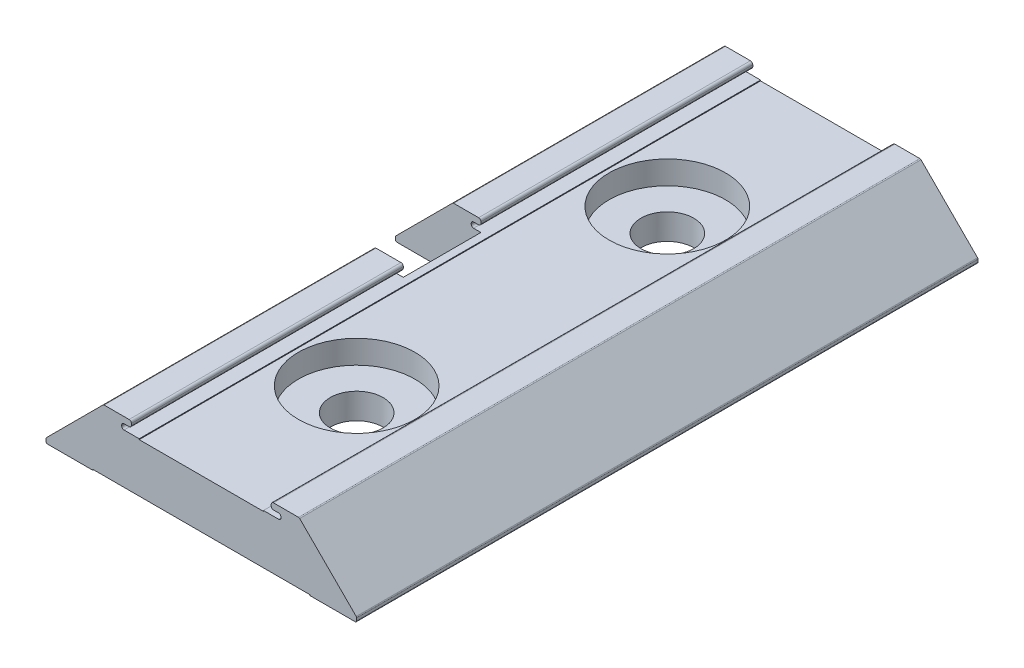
ISO-10303-21;
HEADER;
FILE_DESCRIPTION(('STEP AP214'),'2;1');
FILE_NAME('part.step','',(''),(''),'','','');
FILE_SCHEMA(('AUTOMOTIVE_DESIGN { 1 0 10303 214 1 1 1 1 }'));
ENDSEC;
DATA;
#1=APPLICATION_CONTEXT('core data for automotive mechanical design processes');
#2=APPLICATION_PROTOCOL_DEFINITION('international standard','automotive_design',2000,#1);
#3=PRODUCT_CONTEXT('',#1,'mechanical');
#4=PRODUCT('Part','Part','',(#3));
#5=PRODUCT_RELATED_PRODUCT_CATEGORY('part','',(#4));
#6=PRODUCT_DEFINITION_FORMATION('','',#4);
#7=PRODUCT_DEFINITION_CONTEXT('part definition',#1,'design');
#8=PRODUCT_DEFINITION('design','',#6,#7);
#9=PRODUCT_DEFINITION_SHAPE('','',#8);
#10=(LENGTH_UNIT() NAMED_UNIT(*) SI_UNIT(.MILLI.,.METRE.));
#11=(NAMED_UNIT(*) PLANE_ANGLE_UNIT() SI_UNIT($,.RADIAN.));
#12=(NAMED_UNIT(*) SI_UNIT($,.STERADIAN.) SOLID_ANGLE_UNIT());
#13=UNCERTAINTY_MEASURE_WITH_UNIT(LENGTH_MEASURE(1.E-05),#10,'distance_accuracy_value','');
#14=(GEOMETRIC_REPRESENTATION_CONTEXT(3) GLOBAL_UNCERTAINTY_ASSIGNED_CONTEXT((#13)) GLOBAL_UNIT_ASSIGNED_CONTEXT((#10,
#11,#12)) REPRESENTATION_CONTEXT('',''));
#15=CARTESIAN_POINT('',(0.,0.,0.));
#16=DIRECTION('',(0.,0.,1.));
#17=DIRECTION('',(1.,0.,0.));
#18=AXIS2_PLACEMENT_3D('',#15,#16,#17);
#19=CARTESIAN_POINT('',(3.,0.0499999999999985,40.));
#20=DIRECTION('',(-1.,0.,0.));
#21=DIRECTION('',(0.,-1.,0.));
#22=AXIS2_PLACEMENT_3D('',#19,#20,#21);
#23=PLANE('',#22);
#24=DIRECTION('',(0.,0.,-1.));
#25=VECTOR('',#24,1.);
#26=CARTESIAN_POINT('',(3.,0.0499999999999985,40.));
#27=LINE('',#26,#25);
#28=CARTESIAN_POINT('',(3.,0.0499999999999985,17.5));
#29=VERTEX_POINT('',#28);
#30=CARTESIAN_POINT('',(3.,0.0499999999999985,0.));
#31=VERTEX_POINT('',#30);
#32=EDGE_CURVE('E518',#29,#31,#27,.T.);
#33=ORIENTED_EDGE('',*,*,#32,.F.);
#34=DIRECTION('',(0.,-1.,0.));
#35=VECTOR('',#34,1.);
#36=CARTESIAN_POINT('',(3.,0.0499999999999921,17.5));
#37=LINE('',#36,#35);
#38=CARTESIAN_POINT('',(3.,0.,17.5));
#39=VERTEX_POINT('',#38);
#40=EDGE_CURVE('E966',#29,#39,#37,.T.);
#41=ORIENTED_EDGE('',*,*,#40,.T.);
#42=DIRECTION('',(0.,0.,-1.));
#43=VECTOR('',#42,1.);
#44=CARTESIAN_POINT('',(3.,0.,40.));
#45=LINE('',#44,#43);
#46=CARTESIAN_POINT('',(3.,0.,0.));
#47=VERTEX_POINT('',#46);
#48=EDGE_CURVE('E179',#39,#47,#45,.T.);
#49=ORIENTED_EDGE('',*,*,#48,.T.);
#50=DIRECTION('',(0.,1.,0.));
#51=VECTOR('',#50,1.);
#52=CARTESIAN_POINT('',(3.,0.0499999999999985,0.));
#53=LINE('',#52,#51);
#54=EDGE_CURVE('E318',#47,#31,#53,.T.);
#55=ORIENTED_EDGE('',*,*,#54,.T.);
#56=EDGE_LOOP('',(#33,#41,#49,#55));
#57=FACE_BOUND('',#56,.T.);
#58=ADVANCED_FACE('F37',(#57),#23,.F.);
#59=CARTESIAN_POINT('',(5.025,3.4,40.));
#60=DIRECTION('',(0.,0.,-1.));
#61=DIRECTION('',(-1.,0.,0.));
#62=AXIS2_PLACEMENT_3D('',#59,#60,#61);
#63=CYLINDRICAL_SURFACE('',#62,0.15);
#64=DIRECTION('',(0.,0.,-1.));
#65=VECTOR('',#64,1.);
#66=CARTESIAN_POINT('',(4.875,3.4,40.));
#67=LINE('',#66,#65);
#68=CARTESIAN_POINT('',(4.875,3.4,17.5));
#69=VERTEX_POINT('',#68);
#70=CARTESIAN_POINT('',(4.875,3.4,0.));
#71=VERTEX_POINT('',#70);
#72=EDGE_CURVE('E450',#69,#71,#67,.T.);
#73=ORIENTED_EDGE('',*,*,#72,.F.);
#74=CARTESIAN_POINT('',(5.025,3.4,17.5));
#75=DIRECTION('',(0.,0.,-1.));
#76=DIRECTION('',(0.,1.,0.));
#77=AXIS2_PLACEMENT_3D('',#74,#75,#76);
#78=CIRCLE('',#77,0.15);
#79=CARTESIAN_POINT('',(5.025,3.25,17.5));
#80=VERTEX_POINT('',#79);
#81=EDGE_CURVE('E706',#69,#80,#78,.F.);
#82=ORIENTED_EDGE('',*,*,#81,.T.);
#83=DIRECTION('',(0.,0.,-1.));
#84=VECTOR('',#83,1.);
#85=CARTESIAN_POINT('',(5.025,3.25,40.));
#86=LINE('',#85,#84);
#87=CARTESIAN_POINT('',(5.025,3.25,0.));
#88=VERTEX_POINT('',#87);
#89=EDGE_CURVE('E454',#80,#88,#86,.T.);
#90=ORIENTED_EDGE('',*,*,#89,.T.);
#91=CARTESIAN_POINT('',(5.025,3.4,0.));
#92=DIRECTION('',(0.,0.,-1.));
#93=DIRECTION('',(-1.,0.,0.));
#94=AXIS2_PLACEMENT_3D('',#91,#92,#93);
#95=CIRCLE('',#94,0.15);
#96=EDGE_CURVE('E365',#88,#71,#95,.T.);
#97=ORIENTED_EDGE('',*,*,#96,.T.);
#98=EDGE_LOOP('',(#73,#82,#90,#97));
#99=FACE_BOUND('',#98,.T.);
#100=ADVANCED_FACE('F721',(#99),#63,.F.);
#101=CARTESIAN_POINT('',(4.875,3.45,40.));
#102=DIRECTION('',(-1.,0.,0.));
#103=DIRECTION('',(0.,0.,1.));
#104=AXIS2_PLACEMENT_3D('',#101,#102,#103);
#105=PLANE('',#104);
#106=DIRECTION('',(0.,0.,-1.));
#107=VECTOR('',#106,1.);
#108=CARTESIAN_POINT('',(4.875,3.45,40.));
#109=LINE('',#108,#107);
#110=CARTESIAN_POINT('',(4.875,3.45,17.5));
#111=VERTEX_POINT('',#110);
#112=CARTESIAN_POINT('',(4.875,3.45,0.));
#113=VERTEX_POINT('',#112);
#114=EDGE_CURVE('E446',#111,#113,#109,.T.);
#115=ORIENTED_EDGE('',*,*,#114,.F.);
#116=DIRECTION('',(0.,-1.,0.));
#117=VECTOR('',#116,1.);
#118=CARTESIAN_POINT('',(4.875,3.44999999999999,17.5));
#119=LINE('',#118,#117);
#120=EDGE_CURVE('E722',#111,#69,#119,.T.);
#121=ORIENTED_EDGE('',*,*,#120,.T.);
#122=ORIENTED_EDGE('',*,*,#72,.T.);
#123=DIRECTION('',(0.,1.,0.));
#124=VECTOR('',#123,1.);
#125=CARTESIAN_POINT('',(4.875,3.45,0.));
#126=LINE('',#125,#124);
#127=EDGE_CURVE('E368',#71,#113,#126,.T.);
#128=ORIENTED_EDGE('',*,*,#127,.T.);
#129=EDGE_LOOP('',(#115,#121,#122,#128));
#130=FACE_BOUND('',#129,.T.);
#131=ADVANCED_FACE('F738',(#130),#105,.F.);
#132=CARTESIAN_POINT('',(5.025,3.45,40.));
#133=DIRECTION('',(0.,0.,-1.));
#134=DIRECTION('',(-1.,0.,0.));
#135=AXIS2_PLACEMENT_3D('',#132,#133,#134);
#136=CYLINDRICAL_SURFACE('',#135,0.15);
#137=DIRECTION('',(0.,0.,-1.));
#138=VECTOR('',#137,1.);
#139=CARTESIAN_POINT('',(5.025,3.6,40.));
#140=LINE('',#139,#138);
#141=CARTESIAN_POINT('',(5.025,3.6,17.5));
#142=VERTEX_POINT('',#141);
#143=CARTESIAN_POINT('',(5.025,3.6,0.));
#144=VERTEX_POINT('',#143);
#145=EDGE_CURVE('E442',#142,#144,#140,.T.);
#146=ORIENTED_EDGE('',*,*,#145,.F.);
#147=CARTESIAN_POINT('',(5.025,3.45,17.5));
#148=DIRECTION('',(0.,0.,-1.));
#149=DIRECTION('',(0.,1.,0.));
#150=AXIS2_PLACEMENT_3D('',#147,#148,#149);
#151=CIRCLE('',#150,0.15);
#152=EDGE_CURVE('E740',#142,#111,#151,.F.);
#153=ORIENTED_EDGE('',*,*,#152,.T.);
#154=ORIENTED_EDGE('',*,*,#114,.T.);
#155=CARTESIAN_POINT('',(5.025,3.45,0.));
#156=DIRECTION('',(0.,0.,-1.));
#157=DIRECTION('',(1.,0.,0.));
#158=AXIS2_PLACEMENT_3D('',#155,#156,#157);
#159=CIRCLE('',#158,0.15);
#160=EDGE_CURVE('E371',#113,#144,#159,.T.);
#161=ORIENTED_EDGE('',*,*,#160,.T.);
#162=EDGE_LOOP('',(#146,#153,#154,#161));
#163=FACE_BOUND('',#162,.T.);
#164=ADVANCED_FACE('F863',(#163),#136,.F.);
#165=CARTESIAN_POINT('',(5.35,3.6,40.));
#166=DIRECTION('',(0.,1.,0.));
#167=DIRECTION('',(0.,0.,1.));
#168=AXIS2_PLACEMENT_3D('',#165,#166,#167);
#169=PLANE('',#168);
#170=DIRECTION('',(0.,0.,-1.));
#171=VECTOR('',#170,1.);
#172=CARTESIAN_POINT('',(5.35,3.6,40.));
#173=LINE('',#172,#171);
#174=CARTESIAN_POINT('',(5.35,3.6,17.5));
#175=VERTEX_POINT('',#174);
#176=CARTESIAN_POINT('',(5.35,3.6,0.));
#177=VERTEX_POINT('',#176);
#178=EDGE_CURVE('E438',#175,#177,#173,.T.);
#179=ORIENTED_EDGE('',*,*,#178,.F.);
#180=DIRECTION('',(-1.,0.,0.));
#181=VECTOR('',#180,1.);
#182=CARTESIAN_POINT('',(5.35,3.6,17.5));
#183=LINE('',#182,#181);
#184=EDGE_CURVE('E742',#175,#142,#183,.T.);
#185=ORIENTED_EDGE('',*,*,#184,.T.);
#186=ORIENTED_EDGE('',*,*,#145,.T.);
#187=DIRECTION('',(1.,0.,0.));
#188=VECTOR('',#187,1.);
#189=CARTESIAN_POINT('',(5.35,3.6,0.));
#190=LINE('',#189,#188);
#191=EDGE_CURVE('E374',#144,#177,#190,.T.);
#192=ORIENTED_EDGE('',*,*,#191,.T.);
#193=EDGE_LOOP('',(#179,#185,#186,#192));
#194=FACE_BOUND('',#193,.T.);
#195=ADVANCED_FACE('F858',(#194),#169,.F.);
#196=CARTESIAN_POINT('',(5.35,3.75,40.));
#197=DIRECTION('',(0.,0.,-1.));
#198=DIRECTION('',(-1.,0.,0.));
#199=AXIS2_PLACEMENT_3D('',#196,#197,#198);
#200=CYLINDRICAL_SURFACE('',#199,0.15);
#201=DIRECTION('',(0.,0.,-1.));
#202=VECTOR('',#201,1.);
#203=CARTESIAN_POINT('',(5.5,3.75,40.));
#204=LINE('',#203,#202);
#205=CARTESIAN_POINT('',(5.5,3.75,17.5));
#206=VERTEX_POINT('',#205);
#207=CARTESIAN_POINT('',(5.5,3.75,0.));
#208=VERTEX_POINT('',#207);
#209=EDGE_CURVE('E434',#206,#208,#204,.T.);
#210=ORIENTED_EDGE('',*,*,#209,.F.);
#211=CARTESIAN_POINT('',(5.35,3.75,17.5));
#212=DIRECTION('',(0.,0.,-1.));
#213=DIRECTION('',(0.,1.,0.));
#214=AXIS2_PLACEMENT_3D('',#211,#212,#213);
#215=CIRCLE('',#214,0.15);
#216=EDGE_CURVE('E1015',#206,#175,#215,.T.);
#217=ORIENTED_EDGE('',*,*,#216,.T.);
#218=ORIENTED_EDGE('',*,*,#178,.T.);
#219=CARTESIAN_POINT('',(5.35,3.75,0.));
#220=DIRECTION('',(0.,0.,1.));
#221=DIRECTION('',(-1.,0.,0.));
#222=AXIS2_PLACEMENT_3D('',#219,#220,#221);
#223=CIRCLE('',#222,0.15);
#224=EDGE_CURVE('E377',#177,#208,#223,.T.);
#225=ORIENTED_EDGE('',*,*,#224,.T.);
#226=EDGE_LOOP('',(#210,#217,#218,#225));
#227=FACE_BOUND('',#226,.T.);
#228=ADVANCED_FACE('F853',(#227),#200,.T.);
#229=CARTESIAN_POINT('',(5.5,3.85,40.));
#230=DIRECTION('',(-1.,0.,0.));
#231=DIRECTION('',(0.,0.,1.));
#232=AXIS2_PLACEMENT_3D('',#229,#230,#231);
#233=PLANE('',#232);
#234=DIRECTION('',(0.,0.,-1.));
#235=VECTOR('',#234,1.);
#236=CARTESIAN_POINT('',(5.5,3.85,40.));
#237=LINE('',#236,#235);
#238=CARTESIAN_POINT('',(5.5,3.85,17.5));
#239=VERTEX_POINT('',#238);
#240=CARTESIAN_POINT('',(5.5,3.85,0.));
#241=VERTEX_POINT('',#240);
#242=EDGE_CURVE('E430',#239,#241,#237,.T.);
#243=ORIENTED_EDGE('',*,*,#242,.F.);
#244=DIRECTION('',(0.,-1.,0.));
#245=VECTOR('',#244,1.);
#246=CARTESIAN_POINT('',(5.5,7.83299042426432,17.5));
#247=LINE('',#246,#245);
#248=EDGE_CURVE('E1007',#239,#206,#247,.T.);
#249=ORIENTED_EDGE('',*,*,#248,.T.);
#250=ORIENTED_EDGE('',*,*,#209,.T.);
#251=DIRECTION('',(0.,1.,0.));
#252=VECTOR('',#251,1.);
#253=CARTESIAN_POINT('',(5.5,3.85,0.));
#254=LINE('',#253,#252);
#255=EDGE_CURVE('E380',#208,#241,#254,.T.);
#256=ORIENTED_EDGE('',*,*,#255,.T.);
#257=EDGE_LOOP('',(#243,#249,#250,#256));
#258=FACE_BOUND('',#257,.T.);
#259=ADVANCED_FACE('F848',(#258),#233,.F.);
#260=CARTESIAN_POINT('',(5.35,3.85,40.));
#261=DIRECTION('',(0.,0.,-1.));
#262=DIRECTION('',(-1.,0.,0.));
#263=AXIS2_PLACEMENT_3D('',#260,#261,#262);
#264=CYLINDRICAL_SURFACE('',#263,0.15);
#265=DIRECTION('',(0.,0.,-1.));
#266=VECTOR('',#265,1.);
#267=CARTESIAN_POINT('',(5.35,4.,40.));
#268=LINE('',#267,#266);
#269=CARTESIAN_POINT('',(5.35,4.,17.5));
#270=VERTEX_POINT('',#269);
#271=CARTESIAN_POINT('',(5.35,4.,0.));
#272=VERTEX_POINT('',#271);
#273=EDGE_CURVE('E426',#270,#272,#268,.T.);
#274=ORIENTED_EDGE('',*,*,#273,.F.);
#275=CARTESIAN_POINT('',(5.35,3.85,17.5));
#276=DIRECTION('',(0.,0.,-1.));
#277=DIRECTION('',(0.,1.,0.));
#278=AXIS2_PLACEMENT_3D('',#275,#276,#277);
#279=CIRCLE('',#278,0.15);
#280=EDGE_CURVE('E1003',#270,#239,#279,.T.);
#281=ORIENTED_EDGE('',*,*,#280,.T.);
#282=ORIENTED_EDGE('',*,*,#242,.T.);
#283=CARTESIAN_POINT('',(5.35,3.85,0.));
#284=DIRECTION('',(0.,0.,1.));
#285=DIRECTION('',(-1.,0.,0.));
#286=AXIS2_PLACEMENT_3D('',#283,#284,#285);
#287=CIRCLE('',#286,0.15);
#288=EDGE_CURVE('E383',#241,#272,#287,.T.);
#289=ORIENTED_EDGE('',*,*,#288,.T.);
#290=EDGE_LOOP('',(#274,#281,#282,#289));
#291=FACE_BOUND('',#290,.T.);
#292=ADVANCED_FACE('F843',(#291),#264,.T.);
#293=CARTESIAN_POINT('',(3.74142135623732,4.,40.));
#294=DIRECTION('',(0.,-1.,0.));
#295=DIRECTION('',(0.,0.,-1.));
#296=AXIS2_PLACEMENT_3D('',#293,#294,#295);
#297=PLANE('',#296);
#298=DIRECTION('',(0.,0.,-1.));
#299=VECTOR('',#298,1.);
#300=CARTESIAN_POINT('',(3.74142135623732,4.,40.));
#301=LINE('',#300,#299);
#302=CARTESIAN_POINT('',(3.74142135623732,4.,17.5));
#303=VERTEX_POINT('',#302);
#304=CARTESIAN_POINT('',(3.74142135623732,4.,0.));
#305=VERTEX_POINT('',#304);
#306=EDGE_CURVE('E422',#303,#305,#301,.T.);
#307=ORIENTED_EDGE('',*,*,#306,.F.);
#308=DIRECTION('',(1.,0.,0.));
#309=VECTOR('',#308,1.);
#310=CARTESIAN_POINT('',(3.74142135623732,4.,17.5));
#311=LINE('',#310,#309);
#312=EDGE_CURVE('E1017',#303,#270,#311,.T.);
#313=ORIENTED_EDGE('',*,*,#312,.T.);
#314=ORIENTED_EDGE('',*,*,#273,.T.);
#315=DIRECTION('',(-1.,0.,0.));
#316=VECTOR('',#315,1.);
#317=CARTESIAN_POINT('',(3.74142135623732,4.,0.));
#318=LINE('',#317,#316);
#319=EDGE_CURVE('E386',#272,#305,#318,.T.);
#320=ORIENTED_EDGE('',*,*,#319,.T.);
#321=EDGE_LOOP('',(#307,#313,#314,#320));
#322=FACE_BOUND('',#321,.T.);
#323=ADVANCED_FACE('F838',(#322),#297,.F.);
#324=CARTESIAN_POINT('',(3.74142135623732,3.9,40.));
#325=DIRECTION('',(0.,0.,-1.));
#326=DIRECTION('',(-1.,0.,0.));
#327=AXIS2_PLACEMENT_3D('',#324,#325,#326);
#328=CYLINDRICAL_SURFACE('',#327,0.0999999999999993);
#329=DIRECTION('',(0.,0.,-1.));
#330=VECTOR('',#329,1.);
#331=CARTESIAN_POINT('',(3.67071067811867,3.97071067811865,40.));
#332=LINE('',#331,#330);
#333=CARTESIAN_POINT('',(3.67071067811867,3.97071067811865,17.5));
#334=VERTEX_POINT('',#333);
#335=CARTESIAN_POINT('',(3.67071067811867,3.97071067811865,0.));
#336=VERTEX_POINT('',#335);
#337=EDGE_CURVE('E418',#334,#336,#332,.T.);
#338=ORIENTED_EDGE('',*,*,#337,.F.);
#339=CARTESIAN_POINT('',(3.74142135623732,3.9,17.5));
#340=DIRECTION('',(0.,0.,-1.));
#341=DIRECTION('',(0.,1.,0.));
#342=AXIS2_PLACEMENT_3D('',#339,#340,#341);
#343=CIRCLE('',#342,0.0999999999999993);
#344=EDGE_CURVE('E993',#334,#303,#343,.T.);
#345=ORIENTED_EDGE('',*,*,#344,.T.);
#346=ORIENTED_EDGE('',*,*,#306,.T.);
#347=CARTESIAN_POINT('',(3.74142135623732,3.9,0.));
#348=DIRECTION('',(0.,0.,1.));
#349=DIRECTION('',(-1.,0.,0.));
#350=AXIS2_PLACEMENT_3D('',#347,#348,#349);
#351=CIRCLE('',#350,0.0999999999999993);
#352=EDGE_CURVE('E389',#305,#336,#351,.T.);
#353=ORIENTED_EDGE('',*,*,#352,.T.);
#354=EDGE_LOOP('',(#338,#345,#346,#353));
#355=FACE_BOUND('',#354,.T.);
#356=ADVANCED_FACE('F833',(#355),#328,.T.);
#357=CARTESIAN_POINT('',(0.0292893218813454,0.329289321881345,40.));
#358=DIRECTION('',(0.707106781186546,-0.707106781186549,0.));
#359=DIRECTION('',(0.707106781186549,0.707106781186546,0.));
#360=AXIS2_PLACEMENT_3D('',#357,#358,#359);
#361=PLANE('',#360);
#362=DIRECTION('',(0.,0.,-1.));
#363=VECTOR('',#362,1.);
#364=CARTESIAN_POINT('',(0.0292893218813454,0.329289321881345,40.));
#365=LINE('',#364,#363);
#366=CARTESIAN_POINT('',(0.0292893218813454,0.329289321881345,17.5));
#367=VERTEX_POINT('',#366);
#368=CARTESIAN_POINT('',(0.0292893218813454,0.329289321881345,0.));
#369=VERTEX_POINT('',#368);
#370=EDGE_CURVE('E414',#367,#369,#365,.T.);
#371=ORIENTED_EDGE('',*,*,#370,.F.);
#372=DIRECTION('',(0.707106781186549,0.707106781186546,0.));
#373=VECTOR('',#372,1.);
#374=CARTESIAN_POINT('',(0.0292893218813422,0.329289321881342,17.5));
#375=LINE('',#374,#373);
#376=EDGE_CURVE('E989',#367,#334,#375,.T.);
#377=ORIENTED_EDGE('',*,*,#376,.T.);
#378=ORIENTED_EDGE('',*,*,#337,.T.);
#379=DIRECTION('',(-0.707106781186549,-0.707106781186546,0.));
#380=VECTOR('',#379,1.);
#381=CARTESIAN_POINT('',(0.0292893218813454,0.329289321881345,0.));
#382=LINE('',#381,#380);
#383=EDGE_CURVE('E392',#336,#369,#382,.T.);
#384=ORIENTED_EDGE('',*,*,#383,.T.);
#385=EDGE_LOOP('',(#371,#377,#378,#384));
#386=FACE_BOUND('',#385,.T.);
#387=ADVANCED_FACE('F828',(#386),#361,.F.);
#388=CARTESIAN_POINT('',(0.1,0.25857864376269,40.));
#389=DIRECTION('',(0.,0.,-1.));
#390=DIRECTION('',(-1.,0.,0.));
#391=AXIS2_PLACEMENT_3D('',#388,#389,#390);
#392=CYLINDRICAL_SURFACE('',#391,0.1);
#393=DIRECTION('',(0.,0.,-1.));
#394=VECTOR('',#393,1.);
#395=CARTESIAN_POINT('',(0.,0.25857864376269,40.));
#396=LINE('',#395,#394);
#397=CARTESIAN_POINT('',(0.,0.25857864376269,17.5));
#398=VERTEX_POINT('',#397);
#399=CARTESIAN_POINT('',(0.,0.25857864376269,0.));
#400=VERTEX_POINT('',#399);
#401=EDGE_CURVE('E308',#398,#400,#396,.T.);
#402=ORIENTED_EDGE('',*,*,#401,.F.);
#403=CARTESIAN_POINT('',(0.1,0.25857864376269,17.5));
#404=DIRECTION('',(0.,0.,-1.));
#405=DIRECTION('',(0.,1.,0.));
#406=AXIS2_PLACEMENT_3D('',#403,#404,#405);
#407=CIRCLE('',#406,0.1);
#408=EDGE_CURVE('E1023',#398,#367,#407,.T.);
#409=ORIENTED_EDGE('',*,*,#408,.T.);
#410=ORIENTED_EDGE('',*,*,#370,.T.);
#411=CARTESIAN_POINT('',(0.1,0.25857864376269,0.));
#412=DIRECTION('',(0.,0.,1.));
#413=DIRECTION('',(1.,0.,0.));
#414=AXIS2_PLACEMENT_3D('',#411,#412,#413);
#415=CIRCLE('',#414,0.1);
#416=EDGE_CURVE('E395',#369,#400,#415,.T.);
#417=ORIENTED_EDGE('',*,*,#416,.T.);
#418=EDGE_LOOP('',(#402,#409,#410,#417));
#419=FACE_BOUND('',#418,.T.);
#420=ADVANCED_FACE('F824',(#419),#392,.T.);
#421=CARTESIAN_POINT('',(0.,0.1,40.));
#422=DIRECTION('',(1.,0.,0.));
#423=DIRECTION('',(0.,0.,-1.));
#424=AXIS2_PLACEMENT_3D('',#421,#422,#423);
#425=PLANE('',#424);
#426=DIRECTION('',(0.,0.,-1.));
#427=VECTOR('',#426,1.);
#428=CARTESIAN_POINT('',(0.,0.1,40.));
#429=LINE('',#428,#427);
#430=CARTESIAN_POINT('',(0.,0.1,17.5));
#431=VERTEX_POINT('',#430);
#432=CARTESIAN_POINT('',(0.,0.1,0.));
#433=VERTEX_POINT('',#432);
#434=EDGE_CURVE('E309',#431,#433,#429,.T.);
#435=ORIENTED_EDGE('',*,*,#434,.F.);
#436=DIRECTION('',(0.,-1.,0.));
#437=VECTOR('',#436,1.);
#438=CARTESIAN_POINT('',(0.,7.83299042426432,17.5));
#439=LINE('',#438,#437);
#440=EDGE_CURVE('E979',#398,#431,#439,.T.);
#441=ORIENTED_EDGE('',*,*,#440,.F.);
#442=ORIENTED_EDGE('',*,*,#401,.T.);
#443=DIRECTION('',(0.,-1.,0.));
#444=VECTOR('',#443,1.);
#445=CARTESIAN_POINT('',(0.,0.1,0.));
#446=LINE('',#445,#444);
#447=EDGE_CURVE('E398',#400,#433,#446,.T.);
#448=ORIENTED_EDGE('',*,*,#447,.T.);
#449=EDGE_LOOP('',(#435,#441,#442,#448));
#450=FACE_BOUND('',#449,.T.);
#451=ADVANCED_FACE('F807',(#450),#425,.F.);
#452=CARTESIAN_POINT('',(0.1,0.1,40.));
#453=DIRECTION('',(0.,0.,-1.));
#454=DIRECTION('',(-1.,0.,0.));
#455=AXIS2_PLACEMENT_3D('',#452,#453,#454);
#456=CYLINDRICAL_SURFACE('',#455,0.1);
#457=DIRECTION('',(0.,0.,-1.));
#458=VECTOR('',#457,1.);
#459=CARTESIAN_POINT('',(0.1,0.,40.));
#460=LINE('',#459,#458);
#461=CARTESIAN_POINT('',(0.1,0.,17.5));
#462=VERTEX_POINT('',#461);
#463=CARTESIAN_POINT('',(0.1,0.,0.));
#464=VERTEX_POINT('',#463);
#465=EDGE_CURVE('E410',#462,#464,#460,.T.);
#466=ORIENTED_EDGE('',*,*,#465,.F.);
#467=CARTESIAN_POINT('',(0.1,0.1,17.5));
#468=DIRECTION('',(0.,0.,-1.));
#469=DIRECTION('',(0.,1.,0.));
#470=AXIS2_PLACEMENT_3D('',#467,#468,#469);
#471=CIRCLE('',#470,0.1);
#472=EDGE_CURVE('E968',#462,#431,#471,.T.);
#473=ORIENTED_EDGE('',*,*,#472,.T.);
#474=ORIENTED_EDGE('',*,*,#434,.T.);
#475=CARTESIAN_POINT('',(0.1,0.1,0.));
#476=DIRECTION('',(0.,0.,1.));
#477=DIRECTION('',(-1.,0.,0.));
#478=AXIS2_PLACEMENT_3D('',#475,#476,#477);
#479=CIRCLE('',#478,0.1);
#480=EDGE_CURVE('E401',#433,#464,#479,.T.);
#481=ORIENTED_EDGE('',*,*,#480,.T.);
#482=EDGE_LOOP('',(#466,#473,#474,#481));
#483=FACE_BOUND('',#482,.T.);
#484=ADVANCED_FACE('F801',(#483),#456,.T.);
#485=CARTESIAN_POINT('',(0.1,0.,40.));
#486=DIRECTION('',(0.,1.,0.));
#487=DIRECTION('',(0.,0.,1.));
#488=AXIS2_PLACEMENT_3D('',#485,#486,#487);
#489=PLANE('',#488);
#490=ORIENTED_EDGE('',*,*,#48,.F.);
#491=DIRECTION('',(-1.,0.,0.));
#492=VECTOR('',#491,1.);
#493=CARTESIAN_POINT('',(0.1,0.,17.5));
#494=LINE('',#493,#492);
#495=EDGE_CURVE('E11',#39,#462,#494,.T.);
#496=ORIENTED_EDGE('',*,*,#495,.T.);
#497=ORIENTED_EDGE('',*,*,#465,.T.);
#498=DIRECTION('',(1.,0.,0.));
#499=VECTOR('',#498,1.);
#500=CARTESIAN_POINT('',(0.1,0.,0.));
#501=LINE('',#500,#499);
#502=EDGE_CURVE('E404',#464,#47,#501,.T.);
#503=ORIENTED_EDGE('',*,*,#502,.T.);
#504=EDGE_LOOP('',(#490,#496,#497,#503));
#505=FACE_BOUND('',#504,.T.);
#506=ADVANCED_FACE('F794',(#505),#489,.F.);
#507=CARTESIAN_POINT('',(3.,0.,40.));
#508=VERTEX_POINT('',#507);
#509=CARTESIAN_POINT('',(3.,0.,22.5));
#510=VERTEX_POINT('',#509);
#511=EDGE_CURVE('E407',#508,#510,#45,.T.);
#512=ORIENTED_EDGE('',*,*,#511,.T.);
#513=DIRECTION('',(0.,1.,0.));
#514=VECTOR('',#513,1.);
#515=CARTESIAN_POINT('',(3.,0.0500000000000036,22.5));
#516=LINE('',#515,#514);
#517=CARTESIAN_POINT('',(3.,0.0499999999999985,22.5));
#518=VERTEX_POINT('',#517);
#519=EDGE_CURVE('E52',#510,#518,#516,.T.);
#520=ORIENTED_EDGE('',*,*,#519,.T.);
#521=CARTESIAN_POINT('',(3.,0.0499999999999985,40.));
#522=VERTEX_POINT('',#521);
#523=EDGE_CURVE('E519',#522,#518,#27,.T.);
#524=ORIENTED_EDGE('',*,*,#523,.F.);
#525=DIRECTION('',(0.,1.,0.));
#526=VECTOR('',#525,1.);
#527=CARTESIAN_POINT('',(3.,0.0499999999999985,40.));
#528=LINE('',#527,#526);
#529=EDGE_CURVE('E406',#508,#522,#528,.T.);
#530=ORIENTED_EDGE('',*,*,#529,.F.);
#531=EDGE_LOOP('',(#512,#520,#524,#530));
#532=FACE_BOUND('',#531,.T.);
#533=ADVANCED_FACE('F39',(#532),#23,.F.);
#534=CARTESIAN_POINT('',(17.,0.0500000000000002,40.));
#535=DIRECTION('',(0.,1.,0.));
#536=DIRECTION('',(-1.,0.,0.));
#537=AXIS2_PLACEMENT_3D('',#534,#535,#536);
#538=PLANE('',#537);
#539=CARTESIAN_POINT('',(10.,0.0499999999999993,30.));
#540=DIRECTION('',(0.,1.,0.));
#541=DIRECTION('',(-1.,0.,0.));
#542=AXIS2_PLACEMENT_3D('',#539,#540,#541);
#543=CIRCLE('',#542,1.7);
#544=CARTESIAN_POINT('',(8.3,0.0499999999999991,30.));
#545=VERTEX_POINT('',#544);
#546=EDGE_CURVE('E752',#545,#545,#543,.T.);
#547=ORIENTED_EDGE('',*,*,#546,.T.);
#548=EDGE_LOOP('',(#547));
#549=FACE_BOUND('',#548,.T.);
#550=CARTESIAN_POINT('',(10.,0.0499999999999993,10.));
#551=DIRECTION('',(0.,1.,0.));
#552=DIRECTION('',(-1.,0.,0.));
#553=AXIS2_PLACEMENT_3D('',#550,#551,#552);
#554=CIRCLE('',#553,1.7);
#555=CARTESIAN_POINT('',(8.3,0.0499999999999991,10.));
#556=VERTEX_POINT('',#555);
#557=EDGE_CURVE('E321',#556,#556,#554,.T.);
#558=ORIENTED_EDGE('',*,*,#557,.T.);
#559=EDGE_LOOP('',(#558));
#560=FACE_BOUND('',#559,.T.);
#561=DIRECTION('',(0.,0.,1.));
#562=VECTOR('',#561,1.);
#563=CARTESIAN_POINT('',(5.5,0.0499999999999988,40.));
#564=LINE('',#563,#562);
#565=CARTESIAN_POINT('',(5.5,0.0499999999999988,17.5));
#566=VERTEX_POINT('',#565);
#567=CARTESIAN_POINT('',(5.5,0.0499999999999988,22.5));
#568=VERTEX_POINT('',#567);
#569=EDGE_CURVE('E747',#566,#568,#564,.T.);
#570=ORIENTED_EDGE('',*,*,#569,.F.);
#571=DIRECTION('',(-1.,0.,0.));
#572=VECTOR('',#571,1.);
#573=CARTESIAN_POINT('',(17.,0.0500000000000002,17.5));
#574=LINE('',#573,#572);
#575=EDGE_CURVE('E967',#566,#29,#574,.T.);
#576=ORIENTED_EDGE('',*,*,#575,.T.);
#577=ORIENTED_EDGE('',*,*,#32,.T.);
#578=DIRECTION('',(1.,0.,0.));
#579=VECTOR('',#578,1.);
#580=CARTESIAN_POINT('',(17.,0.0500000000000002,0.));
#581=LINE('',#580,#579);
#582=CARTESIAN_POINT('',(17.,0.0500000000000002,0.));
#583=VERTEX_POINT('',#582);
#584=EDGE_CURVE('E320',#31,#583,#581,.T.);
#585=ORIENTED_EDGE('',*,*,#584,.T.);
#586=DIRECTION('',(0.,0.,-1.));
#587=VECTOR('',#586,1.);
#588=CARTESIAN_POINT('',(17.,0.0500000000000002,40.));
#589=LINE('',#588,#587);
#590=CARTESIAN_POINT('',(17.,0.0500000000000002,40.));
#591=VERTEX_POINT('',#590);
#592=EDGE_CURVE('E515',#591,#583,#589,.T.);
#593=ORIENTED_EDGE('',*,*,#592,.F.);
#594=DIRECTION('',(1.,0.,0.));
#595=VECTOR('',#594,1.);
#596=CARTESIAN_POINT('',(17.,0.0500000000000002,40.));
#597=LINE('',#596,#595);
#598=EDGE_CURVE('E188',#522,#591,#597,.T.);
#599=ORIENTED_EDGE('',*,*,#598,.F.);
#600=ORIENTED_EDGE('',*,*,#523,.T.);
#601=DIRECTION('',(1.,0.,0.));
#602=VECTOR('',#601,1.);
#603=CARTESIAN_POINT('',(17.,0.0500000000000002,22.5));
#604=LINE('',#603,#602);
#605=EDGE_CURVE('E1056',#518,#568,#604,.T.);
#606=ORIENTED_EDGE('',*,*,#605,.T.);
#607=EDGE_LOOP('',(#570,#576,#577,#585,#593,#599,#600,#606));
#608=FACE_BOUND('',#607,.T.);
#609=ADVANCED_FACE('F793',(#549,#560,#608),#538,.F.);
#610=CARTESIAN_POINT('',(17.,0.,40.));
#611=DIRECTION('',(1.,0.,0.));
#612=DIRECTION('',(0.,0.,-1.));
#613=AXIS2_PLACEMENT_3D('',#610,#611,#612);
#614=PLANE('',#613);
#615=DIRECTION('',(0.,-1.,0.));
#616=VECTOR('',#615,1.);
#617=CARTESIAN_POINT('',(17.,0.,0.));
#618=LINE('',#617,#616);
#619=CARTESIAN_POINT('',(17.,0.,0.));
#620=VERTEX_POINT('',#619);
#621=EDGE_CURVE('E323',#583,#620,#618,.T.);
#622=ORIENTED_EDGE('',*,*,#621,.T.);
#623=DIRECTION('',(0.,0.,-1.));
#624=VECTOR('',#623,1.);
#625=CARTESIAN_POINT('',(17.,0.,40.));
#626=LINE('',#625,#624);
#627=CARTESIAN_POINT('',(17.,0.,40.));
#628=VERTEX_POINT('',#627);
#629=EDGE_CURVE('E512',#628,#620,#626,.T.);
#630=ORIENTED_EDGE('',*,*,#629,.F.);
#631=DIRECTION('',(0.,-1.,0.));
#632=VECTOR('',#631,1.);
#633=CARTESIAN_POINT('',(17.,0.,40.));
#634=LINE('',#633,#632);
#635=EDGE_CURVE('E532',#591,#628,#634,.T.);
#636=ORIENTED_EDGE('',*,*,#635,.F.);
#637=ORIENTED_EDGE('',*,*,#592,.T.);
#638=EDGE_LOOP('',(#622,#630,#636,#637));
#639=FACE_BOUND('',#638,.T.);
#640=ADVANCED_FACE('F799',(#639),#614,.F.);
#641=CARTESIAN_POINT('',(19.9,0.,40.));
#642=DIRECTION('',(0.,1.,0.));
#643=DIRECTION('',(-1.,0.,0.));
#644=AXIS2_PLACEMENT_3D('',#641,#642,#643);
#645=PLANE('',#644);
#646=DIRECTION('',(1.,0.,0.));
#647=VECTOR('',#646,1.);
#648=CARTESIAN_POINT('',(19.9,0.,0.));
#649=LINE('',#648,#647);
#650=CARTESIAN_POINT('',(19.9,0.,0.));
#651=VERTEX_POINT('',#650);
#652=EDGE_CURVE('E325',#620,#651,#649,.T.);
#653=ORIENTED_EDGE('',*,*,#652,.T.);
#654=DIRECTION('',(0.,0.,-1.));
#655=VECTOR('',#654,1.);
#656=CARTESIAN_POINT('',(19.9,0.,40.));
#657=LINE('',#656,#655);
#658=CARTESIAN_POINT('',(19.9,0.,40.));
#659=VERTEX_POINT('',#658);
#660=EDGE_CURVE('E509',#659,#651,#657,.T.);
#661=ORIENTED_EDGE('',*,*,#660,.F.);
#662=DIRECTION('',(1.,0.,0.));
#663=VECTOR('',#662,1.);
#664=CARTESIAN_POINT('',(19.9,0.,40.));
#665=LINE('',#664,#663);
#666=EDGE_CURVE('E538',#628,#659,#665,.T.);
#667=ORIENTED_EDGE('',*,*,#666,.F.);
#668=ORIENTED_EDGE('',*,*,#629,.T.);
#669=EDGE_LOOP('',(#653,#661,#667,#668));
#670=FACE_BOUND('',#669,.T.);
#671=ADVANCED_FACE('F938',(#670),#645,.F.);
#672=CARTESIAN_POINT('',(19.9,0.1,40.));
#673=DIRECTION('',(0.,0.,-1.));
#674=DIRECTION('',(-1.,0.,0.));
#675=AXIS2_PLACEMENT_3D('',#672,#673,#674);
#676=CYLINDRICAL_SURFACE('',#675,0.0999999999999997);
#677=CARTESIAN_POINT('',(19.9,0.1,0.));
#678=DIRECTION('',(0.,0.,1.));
#679=DIRECTION('',(-1.,0.,0.));
#680=AXIS2_PLACEMENT_3D('',#677,#678,#679);
#681=CIRCLE('',#680,0.0999999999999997);
#682=CARTESIAN_POINT('',(20.,0.1,0.));
#683=VERTEX_POINT('',#682);
#684=EDGE_CURVE('E327',#651,#683,#681,.T.);
#685=ORIENTED_EDGE('',*,*,#684,.T.);
#686=DIRECTION('',(0.,0.,-1.));
#687=VECTOR('',#686,1.);
#688=CARTESIAN_POINT('',(20.,0.1,40.));
#689=LINE('',#688,#687);
#690=CARTESIAN_POINT('',(20.,0.1,40.));
#691=VERTEX_POINT('',#690);
#692=EDGE_CURVE('E506',#691,#683,#689,.T.);
#693=ORIENTED_EDGE('',*,*,#692,.F.);
#694=CARTESIAN_POINT('',(19.9,0.1,40.));
#695=DIRECTION('',(0.,0.,1.));
#696=DIRECTION('',(-1.,0.,0.));
#697=AXIS2_PLACEMENT_3D('',#694,#695,#696);
#698=CIRCLE('',#697,0.0999999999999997);
#699=EDGE_CURVE('E540',#659,#691,#698,.T.);
#700=ORIENTED_EDGE('',*,*,#699,.F.);
#701=ORIENTED_EDGE('',*,*,#660,.T.);
#702=EDGE_LOOP('',(#685,#693,#700,#701));
#703=FACE_BOUND('',#702,.T.);
#704=ADVANCED_FACE('F934',(#703),#676,.T.);
#705=CARTESIAN_POINT('',(20.,0.25857864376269,40.));
#706=DIRECTION('',(-1.,0.,0.));
#707=DIRECTION('',(0.,0.,1.));
#708=AXIS2_PLACEMENT_3D('',#705,#706,#707);
#709=PLANE('',#708);
#710=DIRECTION('',(0.,1.,0.));
#711=VECTOR('',#710,1.);
#712=CARTESIAN_POINT('',(20.,0.25857864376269,0.));
#713=LINE('',#712,#711);
#714=CARTESIAN_POINT('',(20.,0.25857864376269,0.));
#715=VERTEX_POINT('',#714);
#716=EDGE_CURVE('E329',#683,#715,#713,.T.);
#717=ORIENTED_EDGE('',*,*,#716,.T.);
#718=DIRECTION('',(0.,0.,-1.));
#719=VECTOR('',#718,1.);
#720=CARTESIAN_POINT('',(20.,0.25857864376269,40.));
#721=LINE('',#720,#719);
#722=CARTESIAN_POINT('',(20.,0.25857864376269,40.));
#723=VERTEX_POINT('',#722);
#724=EDGE_CURVE('E503',#723,#715,#721,.T.);
#725=ORIENTED_EDGE('',*,*,#724,.F.);
#726=DIRECTION('',(0.,1.,0.));
#727=VECTOR('',#726,1.);
#728=CARTESIAN_POINT('',(20.,0.25857864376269,40.));
#729=LINE('',#728,#727);
#730=EDGE_CURVE('E542',#691,#723,#729,.T.);
#731=ORIENTED_EDGE('',*,*,#730,.F.);
#732=ORIENTED_EDGE('',*,*,#692,.T.);
#733=EDGE_LOOP('',(#717,#725,#731,#732));
#734=FACE_BOUND('',#733,.T.);
#735=ADVANCED_FACE('F930',(#734),#709,.F.);
#736=CARTESIAN_POINT('',(19.9,0.258578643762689,40.));
#737=DIRECTION('',(0.,0.,-1.));
#738=DIRECTION('',(-1.,0.,0.));
#739=AXIS2_PLACEMENT_3D('',#736,#737,#738);
#740=CYLINDRICAL_SURFACE('',#739,0.0999999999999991);
#741=CARTESIAN_POINT('',(19.9,0.258578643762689,0.));
#742=DIRECTION('',(0.,0.,1.));
#743=DIRECTION('',(-1.,0.,0.));
#744=AXIS2_PLACEMENT_3D('',#741,#742,#743);
#745=CIRCLE('',#744,0.0999999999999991);
#746=CARTESIAN_POINT('',(19.9707106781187,0.329289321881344,0.));
#747=VERTEX_POINT('',#746);
#748=EDGE_CURVE('E331',#715,#747,#745,.T.);
#749=ORIENTED_EDGE('',*,*,#748,.T.);
#750=DIRECTION('',(0.,0.,-1.));
#751=VECTOR('',#750,1.);
#752=CARTESIAN_POINT('',(19.9707106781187,0.329289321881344,40.));
#753=LINE('',#752,#751);
#754=CARTESIAN_POINT('',(19.9707106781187,0.329289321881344,40.));
#755=VERTEX_POINT('',#754);
#756=EDGE_CURVE('E500',#755,#747,#753,.T.);
#757=ORIENTED_EDGE('',*,*,#756,.F.);
#758=CARTESIAN_POINT('',(19.9,0.258578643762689,40.));
#759=DIRECTION('',(0.,0.,1.));
#760=DIRECTION('',(-1.,0.,0.));
#761=AXIS2_PLACEMENT_3D('',#758,#759,#760);
#762=CIRCLE('',#761,0.0999999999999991);
#763=EDGE_CURVE('E544',#723,#755,#762,.T.);
#764=ORIENTED_EDGE('',*,*,#763,.F.);
#765=ORIENTED_EDGE('',*,*,#724,.T.);
#766=EDGE_LOOP('',(#749,#757,#764,#765));
#767=FACE_BOUND('',#766,.T.);
#768=ADVANCED_FACE('F926',(#767),#740,.T.);
#769=CARTESIAN_POINT('',(16.3292893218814,3.97071067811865,40.));
#770=DIRECTION('',(-0.707106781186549,-0.707106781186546,0.));
#771=DIRECTION('',(0.707106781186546,-0.707106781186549,0.));
#772=AXIS2_PLACEMENT_3D('',#769,#770,#771);
#773=PLANE('',#772);
#774=DIRECTION('',(-0.707106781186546,0.707106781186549,0.));
#775=VECTOR('',#774,1.);
#776=CARTESIAN_POINT('',(16.3292893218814,3.97071067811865,0.));
#777=LINE('',#776,#775);
#778=CARTESIAN_POINT('',(16.3292893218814,3.97071067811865,0.));
#779=VERTEX_POINT('',#778);
#780=EDGE_CURVE('E333',#747,#779,#777,.T.);
#781=ORIENTED_EDGE('',*,*,#780,.T.);
#782=DIRECTION('',(0.,0.,-1.));
#783=VECTOR('',#782,1.);
#784=CARTESIAN_POINT('',(16.3292893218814,3.97071067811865,40.));
#785=LINE('',#784,#783);
#786=CARTESIAN_POINT('',(16.3292893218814,3.97071067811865,40.));
#787=VERTEX_POINT('',#786);
#788=EDGE_CURVE('E497',#787,#779,#785,.T.);
#789=ORIENTED_EDGE('',*,*,#788,.F.);
#790=DIRECTION('',(-0.707106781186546,0.707106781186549,0.));
#791=VECTOR('',#790,1.);
#792=CARTESIAN_POINT('',(16.3292893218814,3.97071067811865,40.));
#793=LINE('',#792,#791);
#794=EDGE_CURVE('E546',#755,#787,#793,.T.);
#795=ORIENTED_EDGE('',*,*,#794,.F.);
#796=ORIENTED_EDGE('',*,*,#756,.T.);
#797=EDGE_LOOP('',(#781,#789,#795,#796));
#798=FACE_BOUND('',#797,.T.);
#799=ADVANCED_FACE('F922',(#798),#773,.F.);
#800=CARTESIAN_POINT('',(16.2585786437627,3.9,40.));
#801=DIRECTION('',(0.,0.,-1.));
#802=DIRECTION('',(-1.,0.,0.));
#803=AXIS2_PLACEMENT_3D('',#800,#801,#802);
#804=CYLINDRICAL_SURFACE('',#803,0.100000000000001);
#805=CARTESIAN_POINT('',(16.2585786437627,3.9,0.));
#806=DIRECTION('',(0.,0.,1.));
#807=DIRECTION('',(1.,0.,0.));
#808=AXIS2_PLACEMENT_3D('',#805,#806,#807);
#809=CIRCLE('',#808,0.100000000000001);
#810=CARTESIAN_POINT('',(16.2585786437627,4.,0.));
#811=VERTEX_POINT('',#810);
#812=EDGE_CURVE('E335',#779,#811,#809,.T.);
#813=ORIENTED_EDGE('',*,*,#812,.T.);
#814=DIRECTION('',(0.,0.,-1.));
#815=VECTOR('',#814,1.);
#816=CARTESIAN_POINT('',(16.2585786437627,4.,40.));
#817=LINE('',#816,#815);
#818=CARTESIAN_POINT('',(16.2585786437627,4.,40.));
#819=VERTEX_POINT('',#818);
#820=EDGE_CURVE('E494',#819,#811,#817,.T.);
#821=ORIENTED_EDGE('',*,*,#820,.F.);
#822=CARTESIAN_POINT('',(16.2585786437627,3.9,40.));
#823=DIRECTION('',(0.,0.,1.));
#824=DIRECTION('',(1.,0.,0.));
#825=AXIS2_PLACEMENT_3D('',#822,#823,#824);
#826=CIRCLE('',#825,0.100000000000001);
#827=EDGE_CURVE('E548',#787,#819,#826,.T.);
#828=ORIENTED_EDGE('',*,*,#827,.F.);
#829=ORIENTED_EDGE('',*,*,#788,.T.);
#830=EDGE_LOOP('',(#813,#821,#828,#829));
#831=FACE_BOUND('',#830,.T.);
#832=ADVANCED_FACE('F918',(#831),#804,.T.);
#833=CARTESIAN_POINT('',(14.65,4.,40.));
#834=DIRECTION('',(0.,-1.,0.));
#835=DIRECTION('',(1.,0.,0.));
#836=AXIS2_PLACEMENT_3D('',#833,#834,#835);
#837=PLANE('',#836);
#838=DIRECTION('',(-1.,0.,0.));
#839=VECTOR('',#838,1.);
#840=CARTESIAN_POINT('',(14.65,4.,0.));
#841=LINE('',#840,#839);
#842=CARTESIAN_POINT('',(14.65,4.,0.));
#843=VERTEX_POINT('',#842);
#844=EDGE_CURVE('E337',#811,#843,#841,.T.);
#845=ORIENTED_EDGE('',*,*,#844,.T.);
#846=DIRECTION('',(0.,0.,-1.));
#847=VECTOR('',#846,1.);
#848=CARTESIAN_POINT('',(14.65,4.,40.));
#849=LINE('',#848,#847);
#850=CARTESIAN_POINT('',(14.65,4.,40.));
#851=VERTEX_POINT('',#850);
#852=EDGE_CURVE('E491',#851,#843,#849,.T.);
#853=ORIENTED_EDGE('',*,*,#852,.F.);
#854=DIRECTION('',(-1.,0.,0.));
#855=VECTOR('',#854,1.);
#856=CARTESIAN_POINT('',(14.65,4.,40.));
#857=LINE('',#856,#855);
#858=EDGE_CURVE('E550',#819,#851,#857,.T.);
#859=ORIENTED_EDGE('',*,*,#858,.F.);
#860=ORIENTED_EDGE('',*,*,#820,.T.);
#861=EDGE_LOOP('',(#845,#853,#859,#860));
#862=FACE_BOUND('',#861,.T.);
#863=ADVANCED_FACE('F914',(#862),#837,.F.);
#864=CARTESIAN_POINT('',(14.65,3.85,40.));
#865=DIRECTION('',(0.,0.,-1.));
#866=DIRECTION('',(-1.,0.,0.));
#867=AXIS2_PLACEMENT_3D('',#864,#865,#866);
#868=CYLINDRICAL_SURFACE('',#867,0.150000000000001);
#869=CARTESIAN_POINT('',(14.65,3.85,0.));
#870=DIRECTION('',(0.,0.,1.));
#871=DIRECTION('',(1.,0.,0.));
#872=AXIS2_PLACEMENT_3D('',#869,#870,#871);
#873=CIRCLE('',#872,0.150000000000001);
#874=CARTESIAN_POINT('',(14.5,3.85,0.));
#875=VERTEX_POINT('',#874);
#876=EDGE_CURVE('E339',#843,#875,#873,.T.);
#877=ORIENTED_EDGE('',*,*,#876,.T.);
#878=DIRECTION('',(0.,0.,-1.));
#879=VECTOR('',#878,1.);
#880=CARTESIAN_POINT('',(14.5,3.85,40.));
#881=LINE('',#880,#879);
#882=CARTESIAN_POINT('',(14.5,3.85,40.));
#883=VERTEX_POINT('',#882);
#884=EDGE_CURVE('E488',#883,#875,#881,.T.);
#885=ORIENTED_EDGE('',*,*,#884,.F.);
#886=CARTESIAN_POINT('',(14.65,3.85,40.));
#887=DIRECTION('',(0.,0.,1.));
#888=DIRECTION('',(1.,0.,0.));
#889=AXIS2_PLACEMENT_3D('',#886,#887,#888);
#890=CIRCLE('',#889,0.150000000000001);
#891=EDGE_CURVE('E552',#851,#883,#890,.T.);
#892=ORIENTED_EDGE('',*,*,#891,.F.);
#893=ORIENTED_EDGE('',*,*,#852,.T.);
#894=EDGE_LOOP('',(#877,#885,#892,#893));
#895=FACE_BOUND('',#894,.T.);
#896=ADVANCED_FACE('F910',(#895),#868,.T.);
#897=CARTESIAN_POINT('',(14.5,3.75,40.));
#898=DIRECTION('',(1.,0.,0.));
#899=DIRECTION('',(0.,0.,-1.));
#900=AXIS2_PLACEMENT_3D('',#897,#898,#899);
#901=PLANE('',#900);
#902=DIRECTION('',(0.,-1.,0.));
#903=VECTOR('',#902,1.);
#904=CARTESIAN_POINT('',(14.5,3.75,0.));
#905=LINE('',#904,#903);
#906=CARTESIAN_POINT('',(14.5,3.75,0.));
#907=VERTEX_POINT('',#906);
#908=EDGE_CURVE('E341',#875,#907,#905,.T.);
#909=ORIENTED_EDGE('',*,*,#908,.T.);
#910=DIRECTION('',(0.,0.,-1.));
#911=VECTOR('',#910,1.);
#912=CARTESIAN_POINT('',(14.5,3.75,40.));
#913=LINE('',#912,#911);
#914=CARTESIAN_POINT('',(14.5,3.75,40.));
#915=VERTEX_POINT('',#914);
#916=EDGE_CURVE('E485',#915,#907,#913,.T.);
#917=ORIENTED_EDGE('',*,*,#916,.F.);
#918=DIRECTION('',(0.,-1.,0.));
#919=VECTOR('',#918,1.);
#920=CARTESIAN_POINT('',(14.5,3.75,40.));
#921=LINE('',#920,#919);
#922=EDGE_CURVE('E554',#883,#915,#921,.T.);
#923=ORIENTED_EDGE('',*,*,#922,.F.);
#924=ORIENTED_EDGE('',*,*,#884,.T.);
#925=EDGE_LOOP('',(#909,#917,#923,#924));
#926=FACE_BOUND('',#925,.T.);
#927=ADVANCED_FACE('F906',(#926),#901,.F.);
#928=CARTESIAN_POINT('',(14.65,3.75,40.));
#929=DIRECTION('',(0.,0.,-1.));
#930=DIRECTION('',(-1.,0.,0.));
#931=AXIS2_PLACEMENT_3D('',#928,#929,#930);
#932=CYLINDRICAL_SURFACE('',#931,0.15);
#933=CARTESIAN_POINT('',(14.65,3.75,0.));
#934=DIRECTION('',(0.,0.,1.));
#935=DIRECTION('',(1.,0.,0.));
#936=AXIS2_PLACEMENT_3D('',#933,#934,#935);
#937=CIRCLE('',#936,0.15);
#938=CARTESIAN_POINT('',(14.65,3.6,0.));
#939=VERTEX_POINT('',#938);
#940=EDGE_CURVE('E343',#907,#939,#937,.T.);
#941=ORIENTED_EDGE('',*,*,#940,.T.);
#942=DIRECTION('',(0.,0.,-1.));
#943=VECTOR('',#942,1.);
#944=CARTESIAN_POINT('',(14.65,3.6,40.));
#945=LINE('',#944,#943);
#946=CARTESIAN_POINT('',(14.65,3.6,40.));
#947=VERTEX_POINT('',#946);
#948=EDGE_CURVE('E482',#947,#939,#945,.T.);
#949=ORIENTED_EDGE('',*,*,#948,.F.);
#950=CARTESIAN_POINT('',(14.65,3.75,40.));
#951=DIRECTION('',(0.,0.,1.));
#952=DIRECTION('',(1.,0.,0.));
#953=AXIS2_PLACEMENT_3D('',#950,#951,#952);
#954=CIRCLE('',#953,0.15);
#955=EDGE_CURVE('E556',#915,#947,#954,.T.);
#956=ORIENTED_EDGE('',*,*,#955,.F.);
#957=ORIENTED_EDGE('',*,*,#916,.T.);
#958=EDGE_LOOP('',(#941,#949,#956,#957));
#959=FACE_BOUND('',#958,.T.);
#960=ADVANCED_FACE('F902',(#959),#932,.T.);
#961=CARTESIAN_POINT('',(14.975,3.6,40.));
#962=DIRECTION('',(0.,1.,0.));
#963=DIRECTION('',(0.,0.,1.));
#964=AXIS2_PLACEMENT_3D('',#961,#962,#963);
#965=PLANE('',#964);
#966=DIRECTION('',(1.,0.,0.));
#967=VECTOR('',#966,1.);
#968=CARTESIAN_POINT('',(14.975,3.6,0.));
#969=LINE('',#968,#967);
#970=CARTESIAN_POINT('',(14.975,3.6,0.));
#971=VERTEX_POINT('',#970);
#972=EDGE_CURVE('E345',#939,#971,#969,.T.);
#973=ORIENTED_EDGE('',*,*,#972,.T.);
#974=DIRECTION('',(0.,0.,-1.));
#975=VECTOR('',#974,1.);
#976=CARTESIAN_POINT('',(14.975,3.6,40.));
#977=LINE('',#976,#975);
#978=CARTESIAN_POINT('',(14.975,3.6,40.));
#979=VERTEX_POINT('',#978);
#980=EDGE_CURVE('E479',#979,#971,#977,.T.);
#981=ORIENTED_EDGE('',*,*,#980,.F.);
#982=DIRECTION('',(1.,0.,0.));
#983=VECTOR('',#982,1.);
#984=CARTESIAN_POINT('',(14.975,3.6,40.));
#985=LINE('',#984,#983);
#986=EDGE_CURVE('E558',#947,#979,#985,.T.);
#987=ORIENTED_EDGE('',*,*,#986,.F.);
#988=ORIENTED_EDGE('',*,*,#948,.T.);
#989=EDGE_LOOP('',(#973,#981,#987,#988));
#990=FACE_BOUND('',#989,.T.);
#991=ADVANCED_FACE('F898',(#990),#965,.F.);
#992=CARTESIAN_POINT('',(14.975,3.45,40.));
#993=DIRECTION('',(0.,0.,-1.));
#994=DIRECTION('',(-1.,0.,0.));
#995=AXIS2_PLACEMENT_3D('',#992,#993,#994);
#996=CYLINDRICAL_SURFACE('',#995,0.15);
#997=CARTESIAN_POINT('',(14.975,3.45,0.));
#998=DIRECTION('',(0.,0.,-1.));
#999=DIRECTION('',(-1.,0.,0.));
#1000=AXIS2_PLACEMENT_3D('',#997,#998,#999);
#1001=CIRCLE('',#1000,0.15);
#1002=CARTESIAN_POINT('',(15.125,3.45,0.));
#1003=VERTEX_POINT('',#1002);
#1004=EDGE_CURVE('E347',#971,#1003,#1001,.T.);
#1005=ORIENTED_EDGE('',*,*,#1004,.T.);
#1006=DIRECTION('',(0.,0.,-1.));
#1007=VECTOR('',#1006,1.);
#1008=CARTESIAN_POINT('',(15.125,3.45,40.));
#1009=LINE('',#1008,#1007);
#1010=CARTESIAN_POINT('',(15.125,3.45,40.));
#1011=VERTEX_POINT('',#1010);
#1012=EDGE_CURVE('E476',#1011,#1003,#1009,.T.);
#1013=ORIENTED_EDGE('',*,*,#1012,.F.);
#1014=CARTESIAN_POINT('',(14.975,3.45,40.));
#1015=DIRECTION('',(0.,0.,-1.));
#1016=DIRECTION('',(-1.,0.,0.));
#1017=AXIS2_PLACEMENT_3D('',#1014,#1015,#1016);
#1018=CIRCLE('',#1017,0.15);
#1019=EDGE_CURVE('E560',#979,#1011,#1018,.T.);
#1020=ORIENTED_EDGE('',*,*,#1019,.F.);
#1021=ORIENTED_EDGE('',*,*,#980,.T.);
#1022=EDGE_LOOP('',(#1005,#1013,#1020,#1021));
#1023=FACE_BOUND('',#1022,.T.);
#1024=ADVANCED_FACE('F894',(#1023),#996,.F.);
#1025=CARTESIAN_POINT('',(15.125,3.4,40.));
#1026=DIRECTION('',(1.,0.,0.));
#1027=DIRECTION('',(0.,0.,-1.));
#1028=AXIS2_PLACEMENT_3D('',#1025,#1026,#1027);
#1029=PLANE('',#1028);
#1030=DIRECTION('',(0.,-1.,0.));
#1031=VECTOR('',#1030,1.);
#1032=CARTESIAN_POINT('',(15.125,3.4,0.));
#1033=LINE('',#1032,#1031);
#1034=CARTESIAN_POINT('',(15.125,3.4,0.));
#1035=VERTEX_POINT('',#1034);
#1036=EDGE_CURVE('E349',#1003,#1035,#1033,.T.);
#1037=ORIENTED_EDGE('',*,*,#1036,.T.);
#1038=DIRECTION('',(0.,0.,-1.));
#1039=VECTOR('',#1038,1.);
#1040=CARTESIAN_POINT('',(15.125,3.4,40.));
#1041=LINE('',#1040,#1039);
#1042=CARTESIAN_POINT('',(15.125,3.4,40.));
#1043=VERTEX_POINT('',#1042);
#1044=EDGE_CURVE('E473',#1043,#1035,#1041,.T.);
#1045=ORIENTED_EDGE('',*,*,#1044,.F.);
#1046=DIRECTION('',(0.,-1.,0.));
#1047=VECTOR('',#1046,1.);
#1048=CARTESIAN_POINT('',(15.125,3.4,40.));
#1049=LINE('',#1048,#1047);
#1050=EDGE_CURVE('E562',#1011,#1043,#1049,.T.);
#1051=ORIENTED_EDGE('',*,*,#1050,.F.);
#1052=ORIENTED_EDGE('',*,*,#1012,.T.);
#1053=EDGE_LOOP('',(#1037,#1045,#1051,#1052));
#1054=FACE_BOUND('',#1053,.T.);
#1055=ADVANCED_FACE('F890',(#1054),#1029,.F.);
#1056=CARTESIAN_POINT('',(14.975,3.4,40.));
#1057=DIRECTION('',(0.,0.,-1.));
#1058=DIRECTION('',(-1.,0.,0.));
#1059=AXIS2_PLACEMENT_3D('',#1056,#1057,#1058);
#1060=CYLINDRICAL_SURFACE('',#1059,0.15);
#1061=CARTESIAN_POINT('',(14.975,3.4,0.));
#1062=DIRECTION('',(0.,0.,-1.));
#1063=DIRECTION('',(-1.,0.,0.));
#1064=AXIS2_PLACEMENT_3D('',#1061,#1062,#1063);
#1065=CIRCLE('',#1064,0.15);
#1066=CARTESIAN_POINT('',(14.975,3.25,0.));
#1067=VERTEX_POINT('',#1066);
#1068=EDGE_CURVE('E351',#1035,#1067,#1065,.T.);
#1069=ORIENTED_EDGE('',*,*,#1068,.T.);
#1070=DIRECTION('',(0.,0.,-1.));
#1071=VECTOR('',#1070,1.);
#1072=CARTESIAN_POINT('',(14.975,3.25,40.));
#1073=LINE('',#1072,#1071);
#1074=CARTESIAN_POINT('',(14.975,3.25,40.));
#1075=VERTEX_POINT('',#1074);
#1076=EDGE_CURVE('E470',#1075,#1067,#1073,.T.);
#1077=ORIENTED_EDGE('',*,*,#1076,.F.);
#1078=CARTESIAN_POINT('',(14.975,3.4,40.));
#1079=DIRECTION('',(0.,0.,-1.));
#1080=DIRECTION('',(-1.,0.,0.));
#1081=AXIS2_PLACEMENT_3D('',#1078,#1079,#1080);
#1082=CIRCLE('',#1081,0.15);
#1083=EDGE_CURVE('E564',#1043,#1075,#1082,.T.);
#1084=ORIENTED_EDGE('',*,*,#1083,.F.);
#1085=ORIENTED_EDGE('',*,*,#1044,.T.);
#1086=EDGE_LOOP('',(#1069,#1077,#1084,#1085));
#1087=FACE_BOUND('',#1086,.T.);
#1088=ADVANCED_FACE('F886',(#1087),#1060,.F.);
#1089=CARTESIAN_POINT('',(14.,3.25,40.));
#1090=DIRECTION('',(0.,-1.,0.));
#1091=DIRECTION('',(0.,0.,-1.));
#1092=AXIS2_PLACEMENT_3D('',#1089,#1090,#1091);
#1093=PLANE('',#1092);
#1094=DIRECTION('',(-1.,0.,0.));
#1095=VECTOR('',#1094,1.);
#1096=CARTESIAN_POINT('',(14.,3.25,0.));
#1097=LINE('',#1096,#1095);
#1098=CARTESIAN_POINT('',(14.,3.25,0.));
#1099=VERTEX_POINT('',#1098);
#1100=EDGE_CURVE('E353',#1067,#1099,#1097,.T.);
#1101=ORIENTED_EDGE('',*,*,#1100,.T.);
#1102=DIRECTION('',(0.,0.,-1.));
#1103=VECTOR('',#1102,1.);
#1104=CARTESIAN_POINT('',(14.,3.25,40.));
#1105=LINE('',#1104,#1103);
#1106=CARTESIAN_POINT('',(14.,3.25,40.));
#1107=VERTEX_POINT('',#1106);
#1108=EDGE_CURVE('E467',#1107,#1099,#1105,.T.);
#1109=ORIENTED_EDGE('',*,*,#1108,.F.);
#1110=DIRECTION('',(-1.,0.,0.));
#1111=VECTOR('',#1110,1.);
#1112=CARTESIAN_POINT('',(14.,3.25,40.));
#1113=LINE('',#1112,#1111);
#1114=EDGE_CURVE('E566',#1075,#1107,#1113,.T.);
#1115=ORIENTED_EDGE('',*,*,#1114,.F.);
#1116=ORIENTED_EDGE('',*,*,#1076,.T.);
#1117=EDGE_LOOP('',(#1101,#1109,#1115,#1116));
#1118=FACE_BOUND('',#1117,.T.);
#1119=ADVANCED_FACE('F882',(#1118),#1093,.F.);
#1120=CARTESIAN_POINT('',(14.,3.25,40.));
#1121=DIRECTION('',(1.,0.,0.));
#1122=DIRECTION('',(0.,0.,-1.));
#1123=AXIS2_PLACEMENT_3D('',#1120,#1121,#1122);
#1124=PLANE('',#1123);
#1125=DIRECTION('',(0.,-1.,0.));
#1126=VECTOR('',#1125,1.);
#1127=CARTESIAN_POINT('',(14.,3.25,0.));
#1128=LINE('',#1127,#1126);
#1129=CARTESIAN_POINT('',(14.,3.2,0.));
#1130=VERTEX_POINT('',#1129);
#1131=EDGE_CURVE('E355',#1099,#1130,#1128,.T.);
#1132=ORIENTED_EDGE('',*,*,#1131,.T.);
#1133=DIRECTION('',(0.,0.,-1.));
#1134=VECTOR('',#1133,1.);
#1135=CARTESIAN_POINT('',(14.,3.2,40.));
#1136=LINE('',#1135,#1134);
#1137=CARTESIAN_POINT('',(14.,3.2,40.));
#1138=VERTEX_POINT('',#1137);
#1139=EDGE_CURVE('E464',#1138,#1130,#1136,.T.);
#1140=ORIENTED_EDGE('',*,*,#1139,.F.);
#1141=DIRECTION('',(0.,-1.,0.));
#1142=VECTOR('',#1141,1.);
#1143=CARTESIAN_POINT('',(14.,3.25,40.));
#1144=LINE('',#1143,#1142);
#1145=EDGE_CURVE('E568',#1107,#1138,#1144,.T.);
#1146=ORIENTED_EDGE('',*,*,#1145,.F.);
#1147=ORIENTED_EDGE('',*,*,#1108,.T.);
#1148=EDGE_LOOP('',(#1132,#1140,#1146,#1147));
#1149=FACE_BOUND('',#1148,.T.);
#1150=ADVANCED_FACE('F878',(#1149),#1124,.F.);
#1151=CARTESIAN_POINT('',(6.,3.2,40.));
#1152=DIRECTION('',(0.,-1.,0.));
#1153=DIRECTION('',(0.,0.,-1.));
#1154=AXIS2_PLACEMENT_3D('',#1151,#1152,#1153);
#1155=PLANE('',#1154);
#1156=CARTESIAN_POINT('',(10.,3.2,30.));
#1157=DIRECTION('',(0.,1.,0.));
#1158=DIRECTION('',(0.,0.,1.));
#1159=AXIS2_PLACEMENT_3D('',#1156,#1157,#1158);
#1160=CIRCLE('',#1159,3.75);
#1161=CARTESIAN_POINT('',(10.,3.2,33.75));
#1162=VERTEX_POINT('',#1161);
#1163=EDGE_CURVE('E749',#1162,#1162,#1160,.T.);
#1164=ORIENTED_EDGE('',*,*,#1163,.F.);
#1165=EDGE_LOOP('',(#1164));
#1166=FACE_BOUND('',#1165,.T.);
#1167=CARTESIAN_POINT('',(10.,3.2,10.));
#1168=DIRECTION('',(0.,1.,0.));
#1169=DIRECTION('',(0.,0.,1.));
#1170=AXIS2_PLACEMENT_3D('',#1167,#1168,#1169);
#1171=CIRCLE('',#1170,3.75);
#1172=CARTESIAN_POINT('',(10.,3.2,13.75));
#1173=VERTEX_POINT('',#1172);
#1174=EDGE_CURVE('E761',#1173,#1173,#1171,.T.);
#1175=ORIENTED_EDGE('',*,*,#1174,.F.);
#1176=EDGE_LOOP('',(#1175));
#1177=FACE_BOUND('',#1176,.T.);
#1178=DIRECTION('',(-1.,0.,0.));
#1179=VECTOR('',#1178,1.);
#1180=CARTESIAN_POINT('',(6.,3.2,0.));
#1181=LINE('',#1180,#1179);
#1182=CARTESIAN_POINT('',(6.,3.2,0.));
#1183=VERTEX_POINT('',#1182);
#1184=EDGE_CURVE('E358',#1130,#1183,#1181,.T.);
#1185=ORIENTED_EDGE('',*,*,#1184,.T.);
#1186=DIRECTION('',(0.,0.,-1.));
#1187=VECTOR('',#1186,1.);
#1188=CARTESIAN_POINT('',(6.,3.2,40.));
#1189=LINE('',#1188,#1187);
#1190=CARTESIAN_POINT('',(6.,3.2,40.));
#1191=VERTEX_POINT('',#1190);
#1192=EDGE_CURVE('E461',#1191,#1183,#1189,.T.);
#1193=ORIENTED_EDGE('',*,*,#1192,.F.);
#1194=DIRECTION('',(-1.,0.,0.));
#1195=VECTOR('',#1194,1.);
#1196=CARTESIAN_POINT('',(9.9,3.2,40.));
#1197=LINE('',#1196,#1195);
#1198=EDGE_CURVE('E570',#1138,#1191,#1197,.T.);
#1199=ORIENTED_EDGE('',*,*,#1198,.F.);
#1200=ORIENTED_EDGE('',*,*,#1139,.T.);
#1201=EDGE_LOOP('',(#1185,#1193,#1199,#1200));
#1202=FACE_BOUND('',#1201,.T.);
#1203=ADVANCED_FACE('F874',(#1166,#1177,#1202),#1155,.F.);
#1204=CARTESIAN_POINT('',(6.,3.25,40.));
#1205=DIRECTION('',(-1.,0.,0.));
#1206=DIRECTION('',(0.,0.,1.));
#1207=AXIS2_PLACEMENT_3D('',#1204,#1205,#1206);
#1208=PLANE('',#1207);
#1209=DIRECTION('',(0.,1.,0.));
#1210=VECTOR('',#1209,1.);
#1211=CARTESIAN_POINT('',(6.,3.25,0.));
#1212=LINE('',#1211,#1210);
#1213=CARTESIAN_POINT('',(6.,3.25,0.));
#1214=VERTEX_POINT('',#1213);
#1215=EDGE_CURVE('E360',#1183,#1214,#1212,.T.);
#1216=ORIENTED_EDGE('',*,*,#1215,.T.);
#1217=DIRECTION('',(0.,0.,-1.));
#1218=VECTOR('',#1217,1.);
#1219=CARTESIAN_POINT('',(6.,3.25,40.));
#1220=LINE('',#1219,#1218);
#1221=CARTESIAN_POINT('',(6.,3.25,40.));
#1222=VERTEX_POINT('',#1221);
#1223=EDGE_CURVE('E458',#1222,#1214,#1220,.T.);
#1224=ORIENTED_EDGE('',*,*,#1223,.F.);
#1225=DIRECTION('',(0.,1.,0.));
#1226=VECTOR('',#1225,1.);
#1227=CARTESIAN_POINT('',(6.,3.25,40.));
#1228=LINE('',#1227,#1226);
#1229=EDGE_CURVE('E572',#1191,#1222,#1228,.T.);
#1230=ORIENTED_EDGE('',*,*,#1229,.F.);
#1231=ORIENTED_EDGE('',*,*,#1192,.T.);
#1232=EDGE_LOOP('',(#1216,#1224,#1230,#1231));
#1233=FACE_BOUND('',#1232,.T.);
#1234=ADVANCED_FACE('F871',(#1233),#1208,.F.);
#1235=CARTESIAN_POINT('',(5.025,3.25,40.));
#1236=DIRECTION('',(0.,-1.,0.));
#1237=DIRECTION('',(0.,0.,-1.));
#1238=AXIS2_PLACEMENT_3D('',#1235,#1236,#1237);
#1239=PLANE('',#1238);
#1240=ORIENTED_EDGE('',*,*,#89,.F.);
#1241=DIRECTION('',(1.,0.,0.));
#1242=VECTOR('',#1241,1.);
#1243=CARTESIAN_POINT('',(5.025,3.25,17.5));
#1244=LINE('',#1243,#1242);
#1245=CARTESIAN_POINT('',(5.5,3.25,17.5));
#1246=VERTEX_POINT('',#1245);
#1247=EDGE_CURVE('E710',#80,#1246,#1244,.T.);
#1248=ORIENTED_EDGE('',*,*,#1247,.T.);
#1249=DIRECTION('',(0.,0.,-1.));
#1250=VECTOR('',#1249,1.);
#1251=CARTESIAN_POINT('',(5.5,3.25,40.));
#1252=LINE('',#1251,#1250);
#1253=CARTESIAN_POINT('',(5.5,3.25,22.5));
#1254=VERTEX_POINT('',#1253);
#1255=EDGE_CURVE('E717',#1254,#1246,#1252,.T.);
#1256=ORIENTED_EDGE('',*,*,#1255,.F.);
#1257=DIRECTION('',(-1.,0.,0.));
#1258=VECTOR('',#1257,1.);
#1259=CARTESIAN_POINT('',(5.025,3.25,22.5));
#1260=LINE('',#1259,#1258);
#1261=CARTESIAN_POINT('',(5.025,3.25,22.5));
#1262=VERTEX_POINT('',#1261);
#1263=EDGE_CURVE('E1027',#1254,#1262,#1260,.T.);
#1264=ORIENTED_EDGE('',*,*,#1263,.T.);
#1265=CARTESIAN_POINT('',(5.025,3.25,40.));
#1266=VERTEX_POINT('',#1265);
#1267=EDGE_CURVE('E455',#1266,#1262,#86,.T.);
#1268=ORIENTED_EDGE('',*,*,#1267,.F.);
#1269=DIRECTION('',(-1.,0.,0.));
#1270=VECTOR('',#1269,1.);
#1271=CARTESIAN_POINT('',(5.025,3.25,40.));
#1272=LINE('',#1271,#1270);
#1273=EDGE_CURVE('E574',#1222,#1266,#1272,.T.);
#1274=ORIENTED_EDGE('',*,*,#1273,.F.);
#1275=ORIENTED_EDGE('',*,*,#1223,.T.);
#1276=DIRECTION('',(-1.,0.,0.));
#1277=VECTOR('',#1276,1.);
#1278=CARTESIAN_POINT('',(5.025,3.25,0.));
#1279=LINE('',#1278,#1277);
#1280=EDGE_CURVE('E362',#1214,#88,#1279,.T.);
#1281=ORIENTED_EDGE('',*,*,#1280,.T.);
#1282=EDGE_LOOP('',(#1240,#1248,#1256,#1264,#1268,#1274,#1275,#1281));
#1283=FACE_BOUND('',#1282,.T.);
#1284=ADVANCED_FACE('F724',(#1283),#1239,.F.);
#1285=ORIENTED_EDGE('',*,*,#1267,.T.);
#1286=CARTESIAN_POINT('',(5.025,3.4,22.5));
#1287=DIRECTION('',(0.,0.,1.));
#1288=DIRECTION('',(0.,-1.,0.));
#1289=AXIS2_PLACEMENT_3D('',#1286,#1287,#1288);
#1290=CIRCLE('',#1289,0.15);
#1291=CARTESIAN_POINT('',(4.875,3.4,22.5));
#1292=VERTEX_POINT('',#1291);
#1293=EDGE_CURVE('E1030',#1262,#1292,#1290,.F.);
#1294=ORIENTED_EDGE('',*,*,#1293,.T.);
#1295=CARTESIAN_POINT('',(4.875,3.4,40.));
#1296=VERTEX_POINT('',#1295);
#1297=EDGE_CURVE('E451',#1296,#1292,#67,.T.);
#1298=ORIENTED_EDGE('',*,*,#1297,.F.);
#1299=CARTESIAN_POINT('',(5.025,3.4,40.));
#1300=DIRECTION('',(0.,0.,-1.));
#1301=DIRECTION('',(-1.,0.,0.));
#1302=AXIS2_PLACEMENT_3D('',#1299,#1300,#1301);
#1303=CIRCLE('',#1302,0.15);
#1304=EDGE_CURVE('E576',#1266,#1296,#1303,.T.);
#1305=ORIENTED_EDGE('',*,*,#1304,.F.);
#1306=EDGE_LOOP('',(#1285,#1294,#1298,#1305));
#1307=FACE_BOUND('',#1306,.T.);
#1308=ADVANCED_FACE('F790',(#1307),#63,.F.);
#1309=ORIENTED_EDGE('',*,*,#1297,.T.);
#1310=DIRECTION('',(0.,1.,0.));
#1311=VECTOR('',#1310,1.);
#1312=CARTESIAN_POINT('',(4.875,3.45,22.5));
#1313=LINE('',#1312,#1311);
#1314=CARTESIAN_POINT('',(4.875,3.45,22.5));
#1315=VERTEX_POINT('',#1314);
#1316=EDGE_CURVE('E1033',#1292,#1315,#1313,.T.);
#1317=ORIENTED_EDGE('',*,*,#1316,.T.);
#1318=CARTESIAN_POINT('',(4.875,3.45,40.));
#1319=VERTEX_POINT('',#1318);
#1320=EDGE_CURVE('E447',#1319,#1315,#109,.T.);
#1321=ORIENTED_EDGE('',*,*,#1320,.F.);
#1322=DIRECTION('',(0.,1.,0.));
#1323=VECTOR('',#1322,1.);
#1324=CARTESIAN_POINT('',(4.875,3.45,40.));
#1325=LINE('',#1324,#1323);
#1326=EDGE_CURVE('E578',#1296,#1319,#1325,.T.);
#1327=ORIENTED_EDGE('',*,*,#1326,.F.);
#1328=EDGE_LOOP('',(#1309,#1317,#1321,#1327));
#1329=FACE_BOUND('',#1328,.T.);
#1330=ADVANCED_FACE('F861',(#1329),#105,.F.);
#1331=ORIENTED_EDGE('',*,*,#1320,.T.);
#1332=CARTESIAN_POINT('',(5.025,3.45,22.5));
#1333=DIRECTION('',(0.,0.,1.));
#1334=DIRECTION('',(0.,-1.,0.));
#1335=AXIS2_PLACEMENT_3D('',#1332,#1333,#1334);
#1336=CIRCLE('',#1335,0.15);
#1337=CARTESIAN_POINT('',(5.025,3.6,22.5));
#1338=VERTEX_POINT('',#1337);
#1339=EDGE_CURVE('E1036',#1315,#1338,#1336,.F.);
#1340=ORIENTED_EDGE('',*,*,#1339,.T.);
#1341=CARTESIAN_POINT('',(5.025,3.6,40.));
#1342=VERTEX_POINT('',#1341);
#1343=EDGE_CURVE('E443',#1342,#1338,#140,.T.);
#1344=ORIENTED_EDGE('',*,*,#1343,.F.);
#1345=CARTESIAN_POINT('',(5.025,3.45,40.));
#1346=DIRECTION('',(0.,0.,-1.));
#1347=DIRECTION('',(1.,0.,0.));
#1348=AXIS2_PLACEMENT_3D('',#1345,#1346,#1347);
#1349=CIRCLE('',#1348,0.15);
#1350=EDGE_CURVE('E580',#1319,#1342,#1349,.T.);
#1351=ORIENTED_EDGE('',*,*,#1350,.F.);
#1352=EDGE_LOOP('',(#1331,#1340,#1344,#1351));
#1353=FACE_BOUND('',#1352,.T.);
#1354=ADVANCED_FACE('F856',(#1353),#136,.F.);
#1355=ORIENTED_EDGE('',*,*,#1343,.T.);
#1356=DIRECTION('',(1.,0.,0.));
#1357=VECTOR('',#1356,1.);
#1358=CARTESIAN_POINT('',(5.35,3.6,22.5));
#1359=LINE('',#1358,#1357);
#1360=CARTESIAN_POINT('',(5.35,3.6,22.5));
#1361=VERTEX_POINT('',#1360);
#1362=EDGE_CURVE('E1039',#1338,#1361,#1359,.T.);
#1363=ORIENTED_EDGE('',*,*,#1362,.T.);
#1364=CARTESIAN_POINT('',(5.35,3.6,40.));
#1365=VERTEX_POINT('',#1364);
#1366=EDGE_CURVE('E439',#1365,#1361,#173,.T.);
#1367=ORIENTED_EDGE('',*,*,#1366,.F.);
#1368=DIRECTION('',(1.,0.,0.));
#1369=VECTOR('',#1368,1.);
#1370=CARTESIAN_POINT('',(5.35,3.6,40.));
#1371=LINE('',#1370,#1369);
#1372=EDGE_CURVE('E582',#1342,#1365,#1371,.T.);
#1373=ORIENTED_EDGE('',*,*,#1372,.F.);
#1374=EDGE_LOOP('',(#1355,#1363,#1367,#1373));
#1375=FACE_BOUND('',#1374,.T.);
#1376=ADVANCED_FACE('F851',(#1375),#169,.F.);
#1377=ORIENTED_EDGE('',*,*,#1366,.T.);
#1378=CARTESIAN_POINT('',(5.35,3.75,22.5));
#1379=DIRECTION('',(0.,0.,1.));
#1380=DIRECTION('',(0.,-1.,0.));
#1381=AXIS2_PLACEMENT_3D('',#1378,#1379,#1380);
#1382=CIRCLE('',#1381,0.15);
#1383=CARTESIAN_POINT('',(5.5,3.75,22.5));
#1384=VERTEX_POINT('',#1383);
#1385=EDGE_CURVE('E1042',#1361,#1384,#1382,.T.);
#1386=ORIENTED_EDGE('',*,*,#1385,.T.);
#1387=CARTESIAN_POINT('',(5.5,3.75,40.));
#1388=VERTEX_POINT('',#1387);
#1389=EDGE_CURVE('E435',#1388,#1384,#204,.T.);
#1390=ORIENTED_EDGE('',*,*,#1389,.F.);
#1391=CARTESIAN_POINT('',(5.35,3.75,40.));
#1392=DIRECTION('',(0.,0.,1.));
#1393=DIRECTION('',(-1.,0.,0.));
#1394=AXIS2_PLACEMENT_3D('',#1391,#1392,#1393);
#1395=CIRCLE('',#1394,0.15);
#1396=EDGE_CURVE('E584',#1365,#1388,#1395,.T.);
#1397=ORIENTED_EDGE('',*,*,#1396,.F.);
#1398=EDGE_LOOP('',(#1377,#1386,#1390,#1397));
#1399=FACE_BOUND('',#1398,.T.);
#1400=ADVANCED_FACE('F846',(#1399),#200,.T.);
#1401=ORIENTED_EDGE('',*,*,#1389,.T.);
#1402=DIRECTION('',(0.,1.,0.));
#1403=VECTOR('',#1402,1.);
#1404=CARTESIAN_POINT('',(5.5,7.83299042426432,22.5));
#1405=LINE('',#1404,#1403);
#1406=CARTESIAN_POINT('',(5.5,3.85,22.5));
#1407=VERTEX_POINT('',#1406);
#1408=EDGE_CURVE('E1066',#1384,#1407,#1405,.T.);
#1409=ORIENTED_EDGE('',*,*,#1408,.T.);
#1410=CARTESIAN_POINT('',(5.5,3.85,40.));
#1411=VERTEX_POINT('',#1410);
#1412=EDGE_CURVE('E431',#1411,#1407,#237,.T.);
#1413=ORIENTED_EDGE('',*,*,#1412,.F.);
#1414=DIRECTION('',(0.,1.,0.));
#1415=VECTOR('',#1414,1.);
#1416=CARTESIAN_POINT('',(5.5,3.85,40.));
#1417=LINE('',#1416,#1415);
#1418=EDGE_CURVE('E586',#1388,#1411,#1417,.T.);
#1419=ORIENTED_EDGE('',*,*,#1418,.F.);
#1420=EDGE_LOOP('',(#1401,#1409,#1413,#1419));
#1421=FACE_BOUND('',#1420,.T.);
#1422=ADVANCED_FACE('F841',(#1421),#233,.F.);
#1423=ORIENTED_EDGE('',*,*,#1412,.T.);
#1424=CARTESIAN_POINT('',(5.35,3.85,22.5));
#1425=DIRECTION('',(0.,0.,1.));
#1426=DIRECTION('',(0.,-1.,0.));
#1427=AXIS2_PLACEMENT_3D('',#1424,#1425,#1426);
#1428=CIRCLE('',#1427,0.15);
#1429=CARTESIAN_POINT('',(5.35,4.,22.5));
#1430=VERTEX_POINT('',#1429);
#1431=EDGE_CURVE('E1045',#1407,#1430,#1428,.T.);
#1432=ORIENTED_EDGE('',*,*,#1431,.T.);
#1433=CARTESIAN_POINT('',(5.35,4.,40.));
#1434=VERTEX_POINT('',#1433);
#1435=EDGE_CURVE('E427',#1434,#1430,#268,.T.);
#1436=ORIENTED_EDGE('',*,*,#1435,.F.);
#1437=CARTESIAN_POINT('',(5.35,3.85,40.));
#1438=DIRECTION('',(0.,0.,1.));
#1439=DIRECTION('',(-1.,0.,0.));
#1440=AXIS2_PLACEMENT_3D('',#1437,#1438,#1439);
#1441=CIRCLE('',#1440,0.15);
#1442=EDGE_CURVE('E588',#1411,#1434,#1441,.T.);
#1443=ORIENTED_EDGE('',*,*,#1442,.F.);
#1444=EDGE_LOOP('',(#1423,#1432,#1436,#1443));
#1445=FACE_BOUND('',#1444,.T.);
#1446=ADVANCED_FACE('F836',(#1445),#264,.T.);
#1447=ORIENTED_EDGE('',*,*,#1435,.T.);
#1448=DIRECTION('',(-1.,0.,0.));
#1449=VECTOR('',#1448,1.);
#1450=CARTESIAN_POINT('',(3.74142135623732,4.,22.5));
#1451=LINE('',#1450,#1449);
#1452=CARTESIAN_POINT('',(3.74142135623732,4.,22.5));
#1453=VERTEX_POINT('',#1452);
#1454=EDGE_CURVE('E1048',#1430,#1453,#1451,.T.);
#1455=ORIENTED_EDGE('',*,*,#1454,.T.);
#1456=CARTESIAN_POINT('',(3.74142135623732,4.,40.));
#1457=VERTEX_POINT('',#1456);
#1458=EDGE_CURVE('E423',#1457,#1453,#301,.T.);
#1459=ORIENTED_EDGE('',*,*,#1458,.F.);
#1460=DIRECTION('',(-1.,0.,0.));
#1461=VECTOR('',#1460,1.);
#1462=CARTESIAN_POINT('',(3.74142135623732,4.,40.));
#1463=LINE('',#1462,#1461);
#1464=EDGE_CURVE('E590',#1434,#1457,#1463,.T.);
#1465=ORIENTED_EDGE('',*,*,#1464,.F.);
#1466=EDGE_LOOP('',(#1447,#1455,#1459,#1465));
#1467=FACE_BOUND('',#1466,.T.);
#1468=ADVANCED_FACE('F831',(#1467),#297,.F.);
#1469=ORIENTED_EDGE('',*,*,#1458,.T.);
#1470=CARTESIAN_POINT('',(3.74142135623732,3.9,22.5));
#1471=DIRECTION('',(0.,0.,1.));
#1472=DIRECTION('',(0.,-1.,0.));
#1473=AXIS2_PLACEMENT_3D('',#1470,#1471,#1472);
#1474=CIRCLE('',#1473,0.0999999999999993);
#1475=CARTESIAN_POINT('',(3.67071067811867,3.97071067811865,22.5));
#1476=VERTEX_POINT('',#1475);
#1477=EDGE_CURVE('E1051',#1453,#1476,#1474,.T.);
#1478=ORIENTED_EDGE('',*,*,#1477,.T.);
#1479=CARTESIAN_POINT('',(3.67071067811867,3.97071067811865,40.));
#1480=VERTEX_POINT('',#1479);
#1481=EDGE_CURVE('E419',#1480,#1476,#332,.T.);
#1482=ORIENTED_EDGE('',*,*,#1481,.F.);
#1483=CARTESIAN_POINT('',(3.74142135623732,3.9,40.));
#1484=DIRECTION('',(0.,0.,1.));
#1485=DIRECTION('',(-1.,0.,0.));
#1486=AXIS2_PLACEMENT_3D('',#1483,#1484,#1485);
#1487=CIRCLE('',#1486,0.0999999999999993);
#1488=EDGE_CURVE('E592',#1457,#1480,#1487,.T.);
#1489=ORIENTED_EDGE('',*,*,#1488,.F.);
#1490=EDGE_LOOP('',(#1469,#1478,#1482,#1489));
#1491=FACE_BOUND('',#1490,.T.);
#1492=ADVANCED_FACE('F827',(#1491),#328,.T.);
#1493=ORIENTED_EDGE('',*,*,#1481,.T.);
#1494=DIRECTION('',(-0.707106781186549,-0.707106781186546,0.));
#1495=VECTOR('',#1494,1.);
#1496=CARTESIAN_POINT('',(0.0292893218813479,0.329289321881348,22.5));
#1497=LINE('',#1496,#1495);
#1498=CARTESIAN_POINT('',(0.0292893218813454,0.329289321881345,22.5));
#1499=VERTEX_POINT('',#1498);
#1500=EDGE_CURVE('E604',#1476,#1499,#1497,.T.);
#1501=ORIENTED_EDGE('',*,*,#1500,.T.);
#1502=CARTESIAN_POINT('',(0.0292893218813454,0.329289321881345,40.));
#1503=VERTEX_POINT('',#1502);
#1504=EDGE_CURVE('E415',#1503,#1499,#365,.T.);
#1505=ORIENTED_EDGE('',*,*,#1504,.F.);
#1506=DIRECTION('',(-0.707106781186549,-0.707106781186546,0.));
#1507=VECTOR('',#1506,1.);
#1508=CARTESIAN_POINT('',(0.0292893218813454,0.329289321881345,40.));
#1509=LINE('',#1508,#1507);
#1510=EDGE_CURVE('E594',#1480,#1503,#1509,.T.);
#1511=ORIENTED_EDGE('',*,*,#1510,.F.);
#1512=EDGE_LOOP('',(#1493,#1501,#1505,#1511));
#1513=FACE_BOUND('',#1512,.T.);
#1514=ADVANCED_FACE('F601',(#1513),#361,.F.);
#1515=ORIENTED_EDGE('',*,*,#1504,.T.);
#1516=CARTESIAN_POINT('',(0.1,0.25857864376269,22.5));
#1517=DIRECTION('',(0.,0.,1.));
#1518=DIRECTION('',(0.,-1.,0.));
#1519=AXIS2_PLACEMENT_3D('',#1516,#1517,#1518);
#1520=CIRCLE('',#1519,0.1);
#1521=CARTESIAN_POINT('',(0.,0.25857864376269,22.5));
#1522=VERTEX_POINT('',#1521);
#1523=EDGE_CURVE('E610',#1499,#1522,#1520,.T.);
#1524=ORIENTED_EDGE('',*,*,#1523,.T.);
#1525=CARTESIAN_POINT('',(0.,0.25857864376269,40.));
#1526=VERTEX_POINT('',#1525);
#1527=EDGE_CURVE('E412',#1526,#1522,#396,.T.);
#1528=ORIENTED_EDGE('',*,*,#1527,.F.);
#1529=CARTESIAN_POINT('',(0.1,0.25857864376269,40.));
#1530=DIRECTION('',(0.,0.,1.));
#1531=DIRECTION('',(1.,0.,0.));
#1532=AXIS2_PLACEMENT_3D('',#1529,#1530,#1531);
#1533=CIRCLE('',#1532,0.1);
#1534=EDGE_CURVE('E294',#1503,#1526,#1533,.T.);
#1535=ORIENTED_EDGE('',*,*,#1534,.F.);
#1536=EDGE_LOOP('',(#1515,#1524,#1528,#1535));
#1537=FACE_BOUND('',#1536,.T.);
#1538=ADVANCED_FACE('F607',(#1537),#392,.T.);
#1539=ORIENTED_EDGE('',*,*,#1527,.T.);
#1540=DIRECTION('',(0.,1.,0.));
#1541=VECTOR('',#1540,1.);
#1542=CARTESIAN_POINT('',(0.,7.83299042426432,22.5));
#1543=LINE('',#1542,#1541);
#1544=CARTESIAN_POINT('',(0.,0.1,22.5));
#1545=VERTEX_POINT('',#1544);
#1546=EDGE_CURVE('E305',#1545,#1522,#1543,.T.);
#1547=ORIENTED_EDGE('',*,*,#1546,.F.);
#1548=CARTESIAN_POINT('',(0.,0.1,40.));
#1549=VERTEX_POINT('',#1548);
#1550=EDGE_CURVE('E301',#1549,#1545,#429,.T.);
#1551=ORIENTED_EDGE('',*,*,#1550,.F.);
#1552=DIRECTION('',(0.,-1.,0.));
#1553=VECTOR('',#1552,1.);
#1554=CARTESIAN_POINT('',(0.,0.1,40.));
#1555=LINE('',#1554,#1553);
#1556=EDGE_CURVE('E287',#1526,#1549,#1555,.T.);
#1557=ORIENTED_EDGE('',*,*,#1556,.F.);
#1558=EDGE_LOOP('',(#1539,#1547,#1551,#1557));
#1559=FACE_BOUND('',#1558,.T.);
#1560=ADVANCED_FACE('F302',(#1559),#425,.F.);
#1561=ORIENTED_EDGE('',*,*,#1550,.T.);
#1562=CARTESIAN_POINT('',(0.1,0.1,22.5));
#1563=DIRECTION('',(0.,0.,1.));
#1564=DIRECTION('',(0.,-1.,0.));
#1565=AXIS2_PLACEMENT_3D('',#1562,#1563,#1564);
#1566=CIRCLE('',#1565,0.1);
#1567=CARTESIAN_POINT('',(0.1,0.,22.5));
#1568=VERTEX_POINT('',#1567);
#1569=EDGE_CURVE('E1060',#1545,#1568,#1566,.T.);
#1570=ORIENTED_EDGE('',*,*,#1569,.T.);
#1571=CARTESIAN_POINT('',(0.1,0.,40.));
#1572=VERTEX_POINT('',#1571);
#1573=EDGE_CURVE('E313',#1572,#1568,#460,.T.);
#1574=ORIENTED_EDGE('',*,*,#1573,.F.);
#1575=CARTESIAN_POINT('',(0.1,0.1,40.));
#1576=DIRECTION('',(0.,0.,1.));
#1577=DIRECTION('',(-1.,0.,0.));
#1578=AXIS2_PLACEMENT_3D('',#1575,#1576,#1577);
#1579=CIRCLE('',#1578,0.1);
#1580=EDGE_CURVE('E291',#1549,#1572,#1579,.T.);
#1581=ORIENTED_EDGE('',*,*,#1580,.F.);
#1582=EDGE_LOOP('',(#1561,#1570,#1574,#1581));
#1583=FACE_BOUND('',#1582,.T.);
#1584=ADVANCED_FACE('F311',(#1583),#456,.T.);
#1585=ORIENTED_EDGE('',*,*,#1573,.T.);
#1586=DIRECTION('',(1.,0.,0.));
#1587=VECTOR('',#1586,1.);
#1588=CARTESIAN_POINT('',(0.1,0.,22.5));
#1589=LINE('',#1588,#1587);
#1590=EDGE_CURVE('E45',#1568,#510,#1589,.T.);
#1591=ORIENTED_EDGE('',*,*,#1590,.T.);
#1592=ORIENTED_EDGE('',*,*,#511,.F.);
#1593=DIRECTION('',(1.,0.,0.));
#1594=VECTOR('',#1593,1.);
#1595=CARTESIAN_POINT('',(0.1,0.,40.));
#1596=LINE('',#1595,#1594);
#1597=EDGE_CURVE('E61',#1572,#508,#1596,.T.);
#1598=ORIENTED_EDGE('',*,*,#1597,.F.);
#1599=EDGE_LOOP('',(#1585,#1591,#1592,#1598));
#1600=FACE_BOUND('',#1599,.T.);
#1601=ADVANCED_FACE('F524',(#1600),#489,.F.);
#1602=CARTESIAN_POINT('',(0.1,0.1,40.));
#1603=DIRECTION('',(0.,0.,-1.));
#1604=DIRECTION('',(-1.,0.,0.));
#1605=AXIS2_PLACEMENT_3D('',#1602,#1603,#1604);
#1606=PLANE('',#1605);
#1607=ORIENTED_EDGE('',*,*,#529,.T.);
#1608=ORIENTED_EDGE('',*,*,#598,.T.);
#1609=ORIENTED_EDGE('',*,*,#635,.T.);
#1610=ORIENTED_EDGE('',*,*,#666,.T.);
#1611=ORIENTED_EDGE('',*,*,#699,.T.);
#1612=ORIENTED_EDGE('',*,*,#730,.T.);
#1613=ORIENTED_EDGE('',*,*,#763,.T.);
#1614=ORIENTED_EDGE('',*,*,#794,.T.);
#1615=ORIENTED_EDGE('',*,*,#827,.T.);
#1616=ORIENTED_EDGE('',*,*,#858,.T.);
#1617=ORIENTED_EDGE('',*,*,#891,.T.);
#1618=ORIENTED_EDGE('',*,*,#922,.T.);
#1619=ORIENTED_EDGE('',*,*,#955,.T.);
#1620=ORIENTED_EDGE('',*,*,#986,.T.);
#1621=ORIENTED_EDGE('',*,*,#1019,.T.);
#1622=ORIENTED_EDGE('',*,*,#1050,.T.);
#1623=ORIENTED_EDGE('',*,*,#1083,.T.);
#1624=ORIENTED_EDGE('',*,*,#1114,.T.);
#1625=ORIENTED_EDGE('',*,*,#1145,.T.);
#1626=ORIENTED_EDGE('',*,*,#1198,.T.);
#1627=ORIENTED_EDGE('',*,*,#1229,.T.);
#1628=ORIENTED_EDGE('',*,*,#1273,.T.);
#1629=ORIENTED_EDGE('',*,*,#1304,.T.);
#1630=ORIENTED_EDGE('',*,*,#1326,.T.);
#1631=ORIENTED_EDGE('',*,*,#1350,.T.);
#1632=ORIENTED_EDGE('',*,*,#1372,.T.);
#1633=ORIENTED_EDGE('',*,*,#1396,.T.);
#1634=ORIENTED_EDGE('',*,*,#1418,.T.);
#1635=ORIENTED_EDGE('',*,*,#1442,.T.);
#1636=ORIENTED_EDGE('',*,*,#1464,.T.);
#1637=ORIENTED_EDGE('',*,*,#1488,.T.);
#1638=ORIENTED_EDGE('',*,*,#1510,.T.);
#1639=ORIENTED_EDGE('',*,*,#1534,.T.);
#1640=ORIENTED_EDGE('',*,*,#1556,.T.);
#1641=ORIENTED_EDGE('',*,*,#1580,.T.);
#1642=ORIENTED_EDGE('',*,*,#1597,.T.);
#1643=EDGE_LOOP('',(#1607,#1608,#1609,#1610,#1611,#1612,#1613,#1614,#1615,#1616,#1617,#1618,
#1619,#1620,#1621,#1622,#1623,#1624,#1625,#1626,#1627,#1628,#1629,#1630,#1631,#1632,#1633,#1634,
#1635,#1636,#1637,#1638,#1639,#1640,#1641,#1642));
#1644=FACE_BOUND('',#1643,.T.);
#1645=ADVANCED_FACE('F289',(#1644),#1606,.F.);
#1646=CARTESIAN_POINT('',(0.1,0.1,0.));
#1647=DIRECTION('',(0.,0.,-1.));
#1648=DIRECTION('',(-1.,0.,0.));
#1649=AXIS2_PLACEMENT_3D('',#1646,#1647,#1648);
#1650=PLANE('',#1649);
#1651=ORIENTED_EDGE('',*,*,#54,.F.);
#1652=ORIENTED_EDGE('',*,*,#502,.F.);
#1653=ORIENTED_EDGE('',*,*,#480,.F.);
#1654=ORIENTED_EDGE('',*,*,#447,.F.);
#1655=ORIENTED_EDGE('',*,*,#416,.F.);
#1656=ORIENTED_EDGE('',*,*,#383,.F.);
#1657=ORIENTED_EDGE('',*,*,#352,.F.);
#1658=ORIENTED_EDGE('',*,*,#319,.F.);
#1659=ORIENTED_EDGE('',*,*,#288,.F.);
#1660=ORIENTED_EDGE('',*,*,#255,.F.);
#1661=ORIENTED_EDGE('',*,*,#224,.F.);
#1662=ORIENTED_EDGE('',*,*,#191,.F.);
#1663=ORIENTED_EDGE('',*,*,#160,.F.);
#1664=ORIENTED_EDGE('',*,*,#127,.F.);
#1665=ORIENTED_EDGE('',*,*,#96,.F.);
#1666=ORIENTED_EDGE('',*,*,#1280,.F.);
#1667=ORIENTED_EDGE('',*,*,#1215,.F.);
#1668=ORIENTED_EDGE('',*,*,#1184,.F.);
#1669=ORIENTED_EDGE('',*,*,#1131,.F.);
#1670=ORIENTED_EDGE('',*,*,#1100,.F.);
#1671=ORIENTED_EDGE('',*,*,#1068,.F.);
#1672=ORIENTED_EDGE('',*,*,#1036,.F.);
#1673=ORIENTED_EDGE('',*,*,#1004,.F.);
#1674=ORIENTED_EDGE('',*,*,#972,.F.);
#1675=ORIENTED_EDGE('',*,*,#940,.F.);
#1676=ORIENTED_EDGE('',*,*,#908,.F.);
#1677=ORIENTED_EDGE('',*,*,#876,.F.);
#1678=ORIENTED_EDGE('',*,*,#844,.F.);
#1679=ORIENTED_EDGE('',*,*,#812,.F.);
#1680=ORIENTED_EDGE('',*,*,#780,.F.);
#1681=ORIENTED_EDGE('',*,*,#748,.F.);
#1682=ORIENTED_EDGE('',*,*,#716,.F.);
#1683=ORIENTED_EDGE('',*,*,#684,.F.);
#1684=ORIENTED_EDGE('',*,*,#652,.F.);
#1685=ORIENTED_EDGE('',*,*,#621,.F.);
#1686=ORIENTED_EDGE('',*,*,#584,.F.);
#1687=EDGE_LOOP('',(#1651,#1652,#1653,#1654,#1655,#1656,#1657,#1658,#1659,#1660,#1661,#1662,
#1663,#1664,#1665,#1666,#1667,#1668,#1669,#1670,#1671,#1672,#1673,#1674,#1675,#1676,#1677,#1678,
#1679,#1680,#1681,#1682,#1683,#1684,#1685,#1686));
#1688=FACE_BOUND('',#1687,.T.);
#1689=ADVANCED_FACE('F733',(#1688),#1650,.T.);
#1690=CARTESIAN_POINT('',(10.,3.2,10.));
#1691=DIRECTION('',(0.,1.,0.));
#1692=DIRECTION('',(0.,0.,1.));
#1693=AXIS2_PLACEMENT_3D('',#1690,#1691,#1692);
#1694=CYLINDRICAL_SURFACE('',#1693,1.7);
#1695=CARTESIAN_POINT('',(10.,1.7,10.));
#1696=DIRECTION('',(0.,1.,0.));
#1697=DIRECTION('',(0.,0.,1.));
#1698=AXIS2_PLACEMENT_3D('',#1695,#1696,#1697);
#1699=CIRCLE('',#1698,1.7);
#1700=CARTESIAN_POINT('',(10.,1.7,11.7));
#1701=VERTEX_POINT('',#1700);
#1702=EDGE_CURVE('E522',#1701,#1701,#1699,.T.);
#1703=ORIENTED_EDGE('',*,*,#1702,.T.);
#1704=EDGE_LOOP('',(#1703));
#1705=FACE_BOUND('',#1704,.T.);
#1706=ORIENTED_EDGE('',*,*,#557,.F.);
#1707=EDGE_LOOP('',(#1706));
#1708=FACE_BOUND('',#1707,.T.);
#1709=ADVANCED_FACE('F770',(#1705,#1708),#1694,.F.);
#1710=CARTESIAN_POINT('',(11.7,1.7,10.));
#1711=DIRECTION('',(0.,-1.,0.));
#1712=DIRECTION('',(0.,0.,-1.));
#1713=AXIS2_PLACEMENT_3D('',#1710,#1711,#1712);
#1714=PLANE('',#1713);
#1715=ORIENTED_EDGE('',*,*,#1702,.F.);
#1716=EDGE_LOOP('',(#1715));
#1717=FACE_BOUND('',#1716,.T.);
#1718=CARTESIAN_POINT('',(10.,1.7,10.));
#1719=DIRECTION('',(0.,1.,0.));
#1720=DIRECTION('',(0.,0.,1.));
#1721=AXIS2_PLACEMENT_3D('',#1718,#1719,#1720);
#1722=CIRCLE('',#1721,3.75);
#1723=CARTESIAN_POINT('',(10.,1.7,13.75));
#1724=VERTEX_POINT('',#1723);
#1725=EDGE_CURVE('E763',#1724,#1724,#1722,.T.);
#1726=ORIENTED_EDGE('',*,*,#1725,.T.);
#1727=EDGE_LOOP('',(#1726));
#1728=FACE_BOUND('',#1727,.T.);
#1729=ADVANCED_FACE('F773',(#1717,#1728),#1714,.F.);
#1730=CARTESIAN_POINT('',(10.,3.2,10.));
#1731=DIRECTION('',(0.,1.,0.));
#1732=DIRECTION('',(0.,0.,1.));
#1733=AXIS2_PLACEMENT_3D('',#1730,#1731,#1732);
#1734=CYLINDRICAL_SURFACE('',#1733,3.75);
#1735=ORIENTED_EDGE('',*,*,#1725,.F.);
#1736=EDGE_LOOP('',(#1735));
#1737=FACE_BOUND('',#1736,.T.);
#1738=ORIENTED_EDGE('',*,*,#1174,.T.);
#1739=EDGE_LOOP('',(#1738));
#1740=FACE_BOUND('',#1739,.T.);
#1741=ADVANCED_FACE('F775',(#1737,#1740),#1734,.F.);
#1742=CARTESIAN_POINT('',(10.,3.2,30.));
#1743=DIRECTION('',(0.,1.,0.));
#1744=DIRECTION('',(0.,0.,1.));
#1745=AXIS2_PLACEMENT_3D('',#1742,#1743,#1744);
#1746=CYLINDRICAL_SURFACE('',#1745,1.7);
#1747=CARTESIAN_POINT('',(10.,1.7,30.));
#1748=DIRECTION('',(0.,1.,0.));
#1749=DIRECTION('',(0.,0.,1.));
#1750=AXIS2_PLACEMENT_3D('',#1747,#1748,#1749);
#1751=CIRCLE('',#1750,1.7);
#1752=CARTESIAN_POINT('',(10.,1.7,31.7));
#1753=VERTEX_POINT('',#1752);
#1754=EDGE_CURVE('E758',#1753,#1753,#1751,.T.);
#1755=ORIENTED_EDGE('',*,*,#1754,.T.);
#1756=EDGE_LOOP('',(#1755));
#1757=FACE_BOUND('',#1756,.T.);
#1758=ORIENTED_EDGE('',*,*,#546,.F.);
#1759=EDGE_LOOP('',(#1758));
#1760=FACE_BOUND('',#1759,.T.);
#1761=ADVANCED_FACE('F781',(#1757,#1760),#1746,.F.);
#1762=CARTESIAN_POINT('',(11.7,1.7,30.));
#1763=DIRECTION('',(0.,-1.,0.));
#1764=DIRECTION('',(0.,0.,-1.));
#1765=AXIS2_PLACEMENT_3D('',#1762,#1763,#1764);
#1766=PLANE('',#1765);
#1767=ORIENTED_EDGE('',*,*,#1754,.F.);
#1768=EDGE_LOOP('',(#1767));
#1769=FACE_BOUND('',#1768,.T.);
#1770=CARTESIAN_POINT('',(10.,1.7,30.));
#1771=DIRECTION('',(0.,1.,0.));
#1772=DIRECTION('',(0.,0.,1.));
#1773=AXIS2_PLACEMENT_3D('',#1770,#1771,#1772);
#1774=CIRCLE('',#1773,3.75);
#1775=CARTESIAN_POINT('',(10.,1.7,33.75));
#1776=VERTEX_POINT('',#1775);
#1777=EDGE_CURVE('E755',#1776,#1776,#1774,.T.);
#1778=ORIENTED_EDGE('',*,*,#1777,.T.);
#1779=EDGE_LOOP('',(#1778));
#1780=FACE_BOUND('',#1779,.T.);
#1781=ADVANCED_FACE('F1156',(#1769,#1780),#1766,.F.);
#1782=CARTESIAN_POINT('',(10.,3.2,30.));
#1783=DIRECTION('',(0.,1.,0.));
#1784=DIRECTION('',(0.,0.,1.));
#1785=AXIS2_PLACEMENT_3D('',#1782,#1783,#1784);
#1786=CYLINDRICAL_SURFACE('',#1785,3.75);
#1787=ORIENTED_EDGE('',*,*,#1777,.F.);
#1788=EDGE_LOOP('',(#1787));
#1789=FACE_BOUND('',#1788,.T.);
#1790=ORIENTED_EDGE('',*,*,#1163,.T.);
#1791=EDGE_LOOP('',(#1790));
#1792=FACE_BOUND('',#1791,.T.);
#1793=ADVANCED_FACE('F1081',(#1789,#1792),#1786,.F.);
#1794=CARTESIAN_POINT('',(5.5,-4.23526562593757,17.5));
#1795=DIRECTION('',(-1.,0.,0.));
#1796=DIRECTION('',(0.,0.,1.));
#1797=AXIS2_PLACEMENT_3D('',#1794,#1795,#1796);
#1798=PLANE('',#1797);
#1799=CARTESIAN_POINT('',(5.5,1.75,20.));
#1800=DIRECTION('',(-1.,0.,0.));
#1801=DIRECTION('',(0.,0.,1.));
#1802=AXIS2_PLACEMENT_3D('',#1799,#1800,#1801);
#1803=CIRCLE('',#1802,0.624999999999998);
#1804=CARTESIAN_POINT('',(5.5,1.75,20.625));
#1805=VERTEX_POINT('',#1804);
#1806=EDGE_CURVE('E1072',#1805,#1805,#1803,.T.);
#1807=ORIENTED_EDGE('',*,*,#1806,.F.);
#1808=EDGE_LOOP('',(#1807));
#1809=FACE_BOUND('',#1808,.T.);
#1810=ORIENTED_EDGE('',*,*,#569,.T.);
#1811=EDGE_CURVE('E1062',#568,#1254,#1405,.T.);
#1812=ORIENTED_EDGE('',*,*,#1811,.T.);
#1813=ORIENTED_EDGE('',*,*,#1255,.T.);
#1814=EDGE_CURVE('E713',#1246,#566,#247,.T.);
#1815=ORIENTED_EDGE('',*,*,#1814,.T.);
#1816=EDGE_LOOP('',(#1810,#1812,#1813,#1815));
#1817=FACE_BOUND('',#1816,.T.);
#1818=ADVANCED_FACE('F1078',(#1809,#1817),#1798,.T.);
#1819=CARTESIAN_POINT('',(5.5,7.83299042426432,17.5));
#1820=DIRECTION('',(0.,0.,-1.));
#1821=DIRECTION('',(0.,1.,0.));
#1822=AXIS2_PLACEMENT_3D('',#1819,#1820,#1821);
#1823=PLANE('',#1822);
#1824=ORIENTED_EDGE('',*,*,#81,.F.);
#1825=ORIENTED_EDGE('',*,*,#120,.F.);
#1826=ORIENTED_EDGE('',*,*,#152,.F.);
#1827=ORIENTED_EDGE('',*,*,#184,.F.);
#1828=ORIENTED_EDGE('',*,*,#216,.F.);
#1829=ORIENTED_EDGE('',*,*,#248,.F.);
#1830=ORIENTED_EDGE('',*,*,#280,.F.);
#1831=ORIENTED_EDGE('',*,*,#312,.F.);
#1832=ORIENTED_EDGE('',*,*,#344,.F.);
#1833=ORIENTED_EDGE('',*,*,#376,.F.);
#1834=ORIENTED_EDGE('',*,*,#408,.F.);
#1835=ORIENTED_EDGE('',*,*,#440,.T.);
#1836=ORIENTED_EDGE('',*,*,#472,.F.);
#1837=ORIENTED_EDGE('',*,*,#495,.F.);
#1838=ORIENTED_EDGE('',*,*,#40,.F.);
#1839=ORIENTED_EDGE('',*,*,#575,.F.);
#1840=ORIENTED_EDGE('',*,*,#1814,.F.);
#1841=ORIENTED_EDGE('',*,*,#1247,.F.);
#1842=EDGE_LOOP('',(#1824,#1825,#1826,#1827,#1828,#1829,#1830,#1831,#1832,#1833,#1834,#1835,
#1836,#1837,#1838,#1839,#1840,#1841));
#1843=FACE_BOUND('',#1842,.T.);
#1844=ADVANCED_FACE('F711',(#1843),#1823,.F.);
#1845=CARTESIAN_POINT('',(5.5,7.83299042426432,22.5));
#1846=DIRECTION('',(0.,0.,1.));
#1847=DIRECTION('',(0.,-1.,0.));
#1848=AXIS2_PLACEMENT_3D('',#1845,#1846,#1847);
#1849=PLANE('',#1848);
#1850=ORIENTED_EDGE('',*,*,#1811,.F.);
#1851=ORIENTED_EDGE('',*,*,#605,.F.);
#1852=ORIENTED_EDGE('',*,*,#519,.F.);
#1853=ORIENTED_EDGE('',*,*,#1590,.F.);
#1854=ORIENTED_EDGE('',*,*,#1569,.F.);
#1855=ORIENTED_EDGE('',*,*,#1546,.T.);
#1856=ORIENTED_EDGE('',*,*,#1523,.F.);
#1857=ORIENTED_EDGE('',*,*,#1500,.F.);
#1858=ORIENTED_EDGE('',*,*,#1477,.F.);
#1859=ORIENTED_EDGE('',*,*,#1454,.F.);
#1860=ORIENTED_EDGE('',*,*,#1431,.F.);
#1861=ORIENTED_EDGE('',*,*,#1408,.F.);
#1862=ORIENTED_EDGE('',*,*,#1385,.F.);
#1863=ORIENTED_EDGE('',*,*,#1362,.F.);
#1864=ORIENTED_EDGE('',*,*,#1339,.F.);
#1865=ORIENTED_EDGE('',*,*,#1316,.F.);
#1866=ORIENTED_EDGE('',*,*,#1293,.F.);
#1867=ORIENTED_EDGE('',*,*,#1263,.F.);
#1868=EDGE_LOOP('',(#1850,#1851,#1852,#1853,#1854,#1855,#1856,#1857,#1858,#1859,#1860,#1861,
#1862,#1863,#1864,#1865,#1866,#1867));
#1869=FACE_BOUND('',#1868,.T.);
#1870=ADVANCED_FACE('F1085',(#1869),#1849,.F.);
#1871=CARTESIAN_POINT('',(11.55,1.75,20.));
#1872=DIRECTION('',(-1.,0.,0.));
#1873=DIRECTION('',(0.,0.,1.));
#1874=AXIS2_PLACEMENT_3D('',#1871,#1872,#1873);
#1875=CONICAL_SURFACE('',#1874,0.624999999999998,1.02974425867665);
#1876=CARTESIAN_POINT('',(11.9255378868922,1.75,20.));
#1877=VERTEX_POINT('',#1876);
#1878=VERTEX_LOOP('',#1877);
#1879=FACE_BOUND('',#1878,.T.);
#1880=CARTESIAN_POINT('',(11.55,1.75,20.));
#1881=DIRECTION('',(-1.,0.,0.));
#1882=DIRECTION('',(0.,0.,1.));
#1883=AXIS2_PLACEMENT_3D('',#1880,#1881,#1882);
#1884=CIRCLE('',#1883,0.624999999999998);
#1885=CARTESIAN_POINT('',(11.55,1.75,20.625));
#1886=VERTEX_POINT('',#1885);
#1887=EDGE_CURVE('E1065',#1886,#1886,#1884,.T.);
#1888=ORIENTED_EDGE('',*,*,#1887,.T.);
#1889=EDGE_LOOP('',(#1888));
#1890=FACE_BOUND('',#1889,.T.);
#1891=ADVANCED_FACE('F1144',(#1879,#1890),#1875,.F.);
#1892=CARTESIAN_POINT('',(5.5,1.75,20.));
#1893=DIRECTION('',(-1.,0.,0.));
#1894=DIRECTION('',(0.,0.,1.));
#1895=AXIS2_PLACEMENT_3D('',#1892,#1893,#1894);
#1896=CYLINDRICAL_SURFACE('',#1895,0.624999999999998);
#1897=ORIENTED_EDGE('',*,*,#1887,.F.);
#1898=EDGE_LOOP('',(#1897));
#1899=FACE_BOUND('',#1898,.T.);
#1900=ORIENTED_EDGE('',*,*,#1806,.T.);
#1901=EDGE_LOOP('',(#1900));
#1902=FACE_BOUND('',#1901,.T.);
#1903=ADVANCED_FACE('F1076',(#1899,#1902),#1896,.F.);
#1904=CLOSED_SHELL('',(#58,#100,#131,#164,#195,#228,#259,#292,#323,#356,#387,#420,#451,#484,
#506,#533,#609,#640,#671,#704,#735,#768,#799,#832,#863,#896,#927,#960,#991,#1024,#1055,#1088,
#1119,#1150,#1203,#1234,#1284,#1308,#1330,#1354,#1376,#1400,#1422,#1446,#1468,#1492,#1514,#1538,
#1560,#1584,#1601,#1645,#1689,#1709,#1729,#1741,#1761,#1781,#1793,#1818,#1844,#1870,#1891,#1903));
#1905=MANIFOLD_SOLID_BREP('B2',#1904);
#1906=ADVANCED_BREP_SHAPE_REPRESENTATION('',(#18,#1905),#14);
#1907=SHAPE_DEFINITION_REPRESENTATION(#9,#1906);
ENDSEC;
END-ISO-10303-21;
